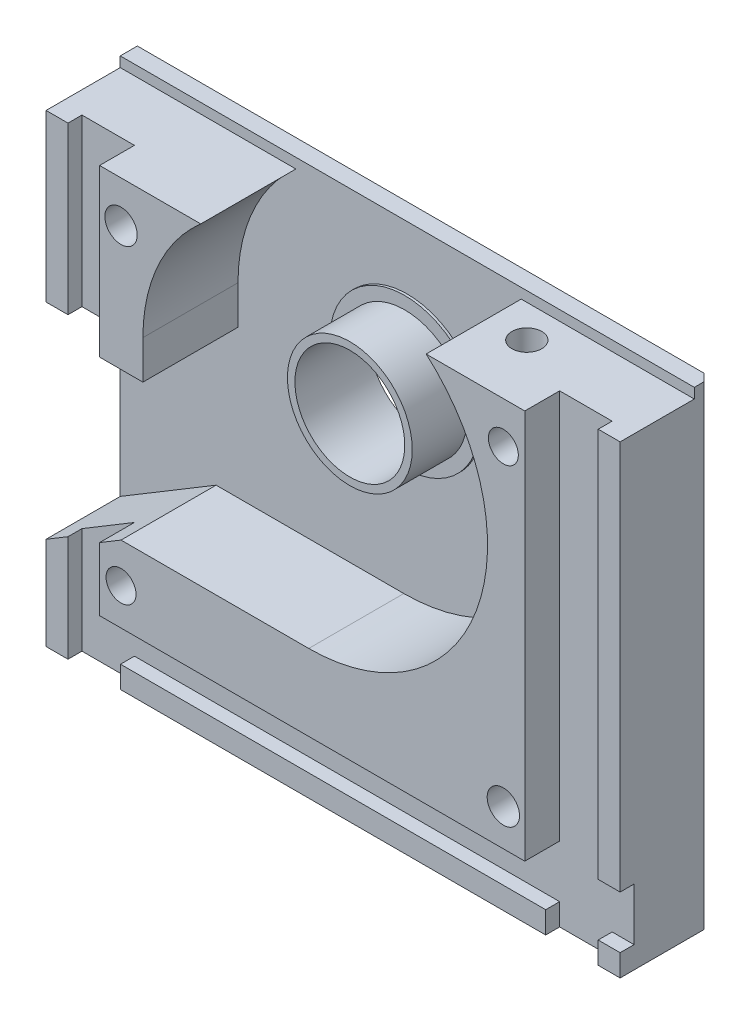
ISO-10303-21;
HEADER;
FILE_DESCRIPTION(('STEP AP214'),'2;1');
FILE_NAME('part.step','',(''),(''),'','','');
FILE_SCHEMA(('AUTOMOTIVE_DESIGN { 1 0 10303 214 1 1 1 1 }'));
ENDSEC;
DATA;
#1=APPLICATION_CONTEXT('core data for automotive mechanical design processes');
#2=APPLICATION_PROTOCOL_DEFINITION('international standard','automotive_design',2000,#1);
#3=PRODUCT_CONTEXT('',#1,'mechanical');
#4=PRODUCT('Part','Part','',(#3));
#5=PRODUCT_RELATED_PRODUCT_CATEGORY('part','',(#4));
#6=PRODUCT_DEFINITION_FORMATION('','',#4);
#7=PRODUCT_DEFINITION_CONTEXT('part definition',#1,'design');
#8=PRODUCT_DEFINITION('design','',#6,#7);
#9=PRODUCT_DEFINITION_SHAPE('','',#8);
#10=(LENGTH_UNIT() NAMED_UNIT(*) SI_UNIT(.MILLI.,.METRE.));
#11=(NAMED_UNIT(*) PLANE_ANGLE_UNIT() SI_UNIT($,.RADIAN.));
#12=(NAMED_UNIT(*) SI_UNIT($,.STERADIAN.) SOLID_ANGLE_UNIT());
#13=UNCERTAINTY_MEASURE_WITH_UNIT(LENGTH_MEASURE(1.E-05),#10,'distance_accuracy_value','');
#14=(GEOMETRIC_REPRESENTATION_CONTEXT(3) GLOBAL_UNCERTAINTY_ASSIGNED_CONTEXT((#13)) GLOBAL_UNIT_ASSIGNED_CONTEXT((#10,
#11,#12)) REPRESENTATION_CONTEXT('',''));
#15=CARTESIAN_POINT('',(0.,0.,0.));
#16=DIRECTION('',(0.,0.,1.));
#17=DIRECTION('',(1.,0.,0.));
#18=AXIS2_PLACEMENT_3D('',#15,#16,#17);
#19=CARTESIAN_POINT('',(42.5902,-63.0918,-6.985));
#20=DIRECTION('',(0.,-1.,0.));
#21=DIRECTION('',(0.,0.,1.));
#22=AXIS2_PLACEMENT_3D('',#19,#20,#21);
#23=PLANE('',#22);
#24=DIRECTION('',(0.,0.,1.));
#25=VECTOR('',#24,1.);
#26=CARTESIAN_POINT('',(-42.5902,-63.0918,-5.588));
#27=LINE('',#26,#25);
#28=CARTESIAN_POINT('',(-42.5902,-63.0918,-6.985));
#29=VERTEX_POINT('',#28);
#30=CARTESIAN_POINT('',(-42.5902,-63.0918,-4.191));
#31=VERTEX_POINT('',#30);
#32=EDGE_CURVE('E545',#29,#31,#27,.T.);
#33=ORIENTED_EDGE('',*,*,#32,.T.);
#34=DIRECTION('',(1.,0.,0.));
#35=VECTOR('',#34,1.);
#36=CARTESIAN_POINT('',(0.,-63.0918,-4.191));
#37=LINE('',#36,#35);
#38=CARTESIAN_POINT('',(42.5902,-63.0918,-4.191));
#39=VERTEX_POINT('',#38);
#40=EDGE_CURVE('E549',#31,#39,#37,.T.);
#41=ORIENTED_EDGE('',*,*,#40,.T.);
#42=DIRECTION('',(0.,0.,-1.));
#43=VECTOR('',#42,1.);
#44=CARTESIAN_POINT('',(42.5902,-63.0918,-5.588));
#45=LINE('',#44,#43);
#46=CARTESIAN_POINT('',(42.5902,-63.0918,-6.985));
#47=VERTEX_POINT('',#46);
#48=EDGE_CURVE('E551',#39,#47,#45,.T.);
#49=ORIENTED_EDGE('',*,*,#48,.T.);
#50=DIRECTION('',(-1.,0.,0.));
#51=VECTOR('',#50,1.);
#52=CARTESIAN_POINT('',(2.19710000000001,-63.0918,-6.985));
#53=LINE('',#52,#51);
#54=EDGE_CURVE('E611',#47,#29,#53,.T.);
#55=ORIENTED_EDGE('',*,*,#54,.T.);
#56=EDGE_LOOP('',(#33,#41,#49,#55));
#57=FACE_BOUND('',#56,.T.);
#58=ADVANCED_FACE('F16',(#57),#23,.F.);
#59=CARTESIAN_POINT('',(53.1058,25.5288,-6.985));
#60=DIRECTION('',(1.,0.,0.));
#61=DIRECTION('',(0.,0.,1.));
#62=AXIS2_PLACEMENT_3D('',#59,#60,#61);
#63=PLANE('',#62);
#64=DIRECTION('',(0.,0.,1.));
#65=VECTOR('',#64,1.);
#66=CARTESIAN_POINT('',(53.1058,-52.5762,-5.588));
#67=LINE('',#66,#65);
#68=CARTESIAN_POINT('',(53.1058,-52.5762,-6.985));
#69=VERTEX_POINT('',#68);
#70=CARTESIAN_POINT('',(53.1058,-52.5762,-4.191));
#71=VERTEX_POINT('',#70);
#72=EDGE_CURVE('E272',#69,#71,#67,.T.);
#73=ORIENTED_EDGE('',*,*,#72,.T.);
#74=DIRECTION('',(0.,1.,0.));
#75=VECTOR('',#74,1.);
#76=CARTESIAN_POINT('',(53.1058,-13.5237,-4.191));
#77=LINE('',#76,#75);
#78=CARTESIAN_POINT('',(53.1058,25.5288,-4.191));
#79=VERTEX_POINT('',#78);
#80=EDGE_CURVE('E269',#71,#79,#77,.T.);
#81=ORIENTED_EDGE('',*,*,#80,.T.);
#82=DIRECTION('',(0.,0.,-1.));
#83=VECTOR('',#82,1.);
#84=CARTESIAN_POINT('',(53.1058,25.5288,-9.525));
#85=LINE('',#84,#83);
#86=CARTESIAN_POINT('',(53.1058,25.5288,-6.985));
#87=VERTEX_POINT('',#86);
#88=EDGE_CURVE('E569',#79,#87,#85,.T.);
#89=ORIENTED_EDGE('',*,*,#88,.T.);
#90=DIRECTION('',(0.,-1.,0.));
#91=VECTOR('',#90,1.);
#92=CARTESIAN_POINT('',(53.1058,-20.9786,-6.985));
#93=LINE('',#92,#91);
#94=EDGE_CURVE('E565',#87,#69,#93,.T.);
#95=ORIENTED_EDGE('',*,*,#94,.T.);
#96=EDGE_LOOP('',(#73,#81,#89,#95));
#97=FACE_BOUND('',#96,.T.);
#98=ADVANCED_FACE('F806',(#97),#63,.F.);
#99=CARTESIAN_POINT('',(30.5,12.8288,-12.5));
#100=DIRECTION('',(0.,-1.,0.));
#101=DIRECTION('',(0.,0.,-1.));
#102=AXIS2_PLACEMENT_3D('',#99,#100,#101);
#103=CYLINDRICAL_SURFACE('',#102,3.);
#104=CARTESIAN_POINT('',(30.5,25.5288,-12.5));
#105=DIRECTION('',(0.,-1.,0.));
#106=DIRECTION('',(0.,0.,-1.));
#107=AXIS2_PLACEMENT_3D('',#104,#105,#106);
#108=CIRCLE('',#107,3.);
#109=CARTESIAN_POINT('',(30.5,25.5288,-15.5));
#110=VERTEX_POINT('',#109);
#111=EDGE_CURVE('E284',#110,#110,#108,.F.);
#112=ORIENTED_EDGE('',*,*,#111,.T.);
#113=EDGE_LOOP('',(#112));
#114=FACE_BOUND('',#113,.T.);
#115=CARTESIAN_POINT('',(27.5,20.6063922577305,-12.5));
#116=CARTESIAN_POINT('',(27.5000026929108,20.6063891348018,-12.6225782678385));
#117=CARTESIAN_POINT('',(27.5075880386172,20.5967226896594,-12.7451733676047));
#118=CARTESIAN_POINT('',(27.5370954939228,20.5590009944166,-12.9857204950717));
#119=CARTESIAN_POINT('',(27.5590301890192,20.5309296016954,-13.1036683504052));
#120=CARTESIAN_POINT('',(27.6148685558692,20.459114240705,-13.3303974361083));
#121=CARTESIAN_POINT('',(27.6486710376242,20.4155027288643,-13.4392468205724));
#122=CARTESIAN_POINT('',(27.7257572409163,20.3154223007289,-13.647123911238));
#123=CARTESIAN_POINT('',(27.7690454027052,20.2589473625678,-13.7461469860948));
#124=CARTESIAN_POINT('',(27.8854020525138,20.1060162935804,-13.9792241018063));
#125=CARTESIAN_POINT('',(27.9627544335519,20.0034258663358,-14.1070902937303));
#126=CARTESIAN_POINT('',(28.1271474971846,19.782533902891,-14.3412335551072));
#127=CARTESIAN_POINT('',(28.2142123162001,19.6641930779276,-14.4474548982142));
#128=CARTESIAN_POINT('',(28.3756698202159,19.4416187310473,-14.6209088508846));
#129=CARTESIAN_POINT('',(28.4490691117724,19.339365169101,-14.6916828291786));
#130=CARTESIAN_POINT('',(28.5980200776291,19.1294192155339,-14.8221288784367));
#131=CARTESIAN_POINT('',(28.6735730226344,19.0217235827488,-14.8817942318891));
#132=CARTESIAN_POINT('',(28.8258247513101,18.8020466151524,-14.9911703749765));
#133=CARTESIAN_POINT('',(28.9025245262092,18.6900614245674,-15.040871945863));
#134=CARTESIAN_POINT('',(29.0562864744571,18.4627369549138,-15.1312813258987));
#135=CARTESIAN_POINT('',(29.133348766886,18.3473964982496,-15.1719859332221));
#136=CARTESIAN_POINT('',(29.3433498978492,18.0290198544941,-15.271986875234));
#137=CARTESIAN_POINT('',(29.4760976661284,17.8233088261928,-15.323225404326));
#138=CARTESIAN_POINT('',(29.7391117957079,17.4062512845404,-15.4051707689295));
#139=CARTESIAN_POINT('',(29.8693762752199,17.1949007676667,-15.4358625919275));
#140=CARTESIAN_POINT('',(30.1266677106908,16.7674904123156,-15.4795471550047));
#141=CARTESIAN_POINT('',(30.2536820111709,16.5514168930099,-15.4924787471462));
#142=CARTESIAN_POINT('',(30.5032487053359,16.1164472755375,-15.5025956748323));
#143=CARTESIAN_POINT('',(30.6258020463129,15.8975517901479,-15.4997843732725));
#144=CARTESIAN_POINT('',(30.8388648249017,15.5074524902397,-15.4822580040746));
#145=CARTESIAN_POINT('',(30.9303581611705,15.3366473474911,-15.4703759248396));
#146=CARTESIAN_POINT('',(31.1102767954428,14.9941359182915,-15.4386915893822));
#147=CARTESIAN_POINT('',(31.1987017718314,14.8224295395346,-15.4188885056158));
#148=CARTESIAN_POINT('',(31.3724307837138,14.4782966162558,-15.3717541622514));
#149=CARTESIAN_POINT('',(31.4577321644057,14.3058695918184,-15.3444166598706));
#150=CARTESIAN_POINT('',(31.6250508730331,13.9607251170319,-15.2824843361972));
#151=CARTESIAN_POINT('',(31.7070681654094,13.7880076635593,-15.247889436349));
#152=CARTESIAN_POINT('',(31.8674384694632,13.4432417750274,-15.1716968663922));
#153=CARTESIAN_POINT('',(31.9458041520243,13.2711932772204,-15.1301261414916));
#154=CARTESIAN_POINT('',(32.0991158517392,12.9274768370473,-15.0398315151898));
#155=CARTESIAN_POINT('',(32.1740623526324,12.755808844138,-14.9911086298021));
#156=CARTESIAN_POINT('',(32.3203871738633,12.4134228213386,-14.8862700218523));
#157=CARTESIAN_POINT('',(32.3917689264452,12.2427040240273,-14.8301616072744));
#158=CARTESIAN_POINT('',(32.5309113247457,11.9026400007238,-14.7099462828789));
#159=CARTESIAN_POINT('',(32.598672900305,11.7332944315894,-14.6458414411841));
#160=CARTESIAN_POINT('',(32.6982855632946,11.4788291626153,-14.5420355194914));
#161=CARTESIAN_POINT('',(32.7315409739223,11.3928902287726,-14.5056700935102));
#162=CARTESIAN_POINT('',(32.7970137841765,11.2217573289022,-14.4303420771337));
#163=CARTESIAN_POINT('',(32.8292312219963,11.1365633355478,-14.3913795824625));
#164=CARTESIAN_POINT('',(32.8926298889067,10.9669887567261,-14.3105155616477));
#165=CARTESIAN_POINT('',(32.9238092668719,10.8826097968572,-14.2686091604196));
#166=CARTESIAN_POINT('',(32.9849977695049,10.7151123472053,-14.1815522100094));
#167=CARTESIAN_POINT('',(33.0150069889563,10.6319937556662,-14.1364019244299));
#168=CARTESIAN_POINT('',(33.0739882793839,10.4667569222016,-14.0419824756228));
#169=CARTESIAN_POINT('',(33.1029499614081,10.3846522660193,-13.9926828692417));
#170=CARTESIAN_POINT('',(33.1594036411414,10.2227824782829,-13.8896138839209));
#171=CARTESIAN_POINT('',(33.1868960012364,10.1430167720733,-13.8358456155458));
#172=CARTESIAN_POINT('',(33.2401053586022,9.98691762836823,-13.7229932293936));
#173=CARTESIAN_POINT('',(33.2658254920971,9.91057821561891,-13.6639189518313));
#174=CARTESIAN_POINT('',(33.3150811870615,9.76283072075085,-13.5391426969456));
#175=CARTESIAN_POINT('',(33.3386196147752,9.69141620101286,-13.4734496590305));
#176=CARTESIAN_POINT('',(33.3803508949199,9.56357978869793,-13.3413339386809));
#177=CARTESIAN_POINT('',(33.3988468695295,9.50637252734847,-13.2757798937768));
#178=CARTESIAN_POINT('',(33.4325244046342,9.401434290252,-13.136703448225));
#179=CARTESIAN_POINT('',(33.4477160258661,9.3536745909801,-13.06320628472));
#180=CARTESIAN_POINT('',(33.4686616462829,9.28747650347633,-12.9354335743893));
#181=CARTESIAN_POINT('',(33.4758474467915,9.26466164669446,-12.8836928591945));
#182=CARTESIAN_POINT('',(33.4876574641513,9.22707733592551,-12.7770712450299));
#183=CARTESIAN_POINT('',(33.4922849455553,9.21229762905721,-12.722194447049));
#184=CARTESIAN_POINT('',(33.498513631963,9.19238763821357,-12.6099688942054));
#185=CARTESIAN_POINT('',(33.5000869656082,9.1873462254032,-12.552602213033));
#186=CARTESIAN_POINT('',(33.4999055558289,9.18792701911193,-12.4379245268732));
#187=CARTESIAN_POINT('',(33.4981507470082,9.19354943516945,-12.380613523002));
#188=CARTESIAN_POINT('',(33.4919226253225,9.21345401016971,-12.2743403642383));
#189=CARTESIAN_POINT('',(33.4877722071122,9.2267071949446,-12.2251569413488));
#190=CARTESIAN_POINT('',(33.4773987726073,9.25972893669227,-12.1292927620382));
#191=CARTESIAN_POINT('',(33.4711748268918,9.27950041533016,-12.0826131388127));
#192=CARTESIAN_POINT('',(33.4518630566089,9.34060623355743,-11.9588655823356));
#193=CARTESIAN_POINT('',(33.4370901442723,9.38711633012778,-11.8846383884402));
#194=CARTESIAN_POINT('',(33.4041293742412,9.48998059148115,-11.7441742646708));
#195=CARTESIAN_POINT('',(33.3859289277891,9.54637099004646,-11.6779683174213));
#196=CARTESIAN_POINT('',(33.3421174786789,9.680817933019,-11.5360374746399));
#197=CARTESIAN_POINT('',(33.3158080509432,9.76070326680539,-11.4622883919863));
#198=CARTESIAN_POINT('',(33.2604829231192,9.92654603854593,-11.3229929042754));
#199=CARTESIAN_POINT('',(33.2314622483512,10.0125145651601,-11.2574621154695));
#200=CARTESIAN_POINT('',(33.1711806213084,10.1887562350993,-11.1326623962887));
#201=CARTESIAN_POINT('',(33.1399095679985,10.2790480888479,-11.0734250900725));
#202=CARTESIAN_POINT('',(33.0756170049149,10.4622273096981,-10.9603850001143));
#203=CARTESIAN_POINT('',(33.0425968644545,10.5551126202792,-10.9065780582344));
#204=CARTESIAN_POINT('',(32.9613873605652,10.7805228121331,-10.7827174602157));
#205=CARTESIAN_POINT('',(32.9124388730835,10.9139637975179,-10.7148344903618));
#206=CARTESIAN_POINT('',(32.8117791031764,11.1832833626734,-10.5862785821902));
#207=CARTESIAN_POINT('',(32.7600667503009,11.3191628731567,-10.5256084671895));
#208=CARTESIAN_POINT('',(32.6540055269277,11.5927366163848,-10.4104075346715));
#209=CARTESIAN_POINT('',(32.599652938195,11.7304331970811,-10.3558857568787));
#210=CARTESIAN_POINT('',(32.4884945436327,12.0069393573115,-10.2524118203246));
#211=CARTESIAN_POINT('',(32.4316883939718,12.145749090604,-10.2034604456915));
#212=CARTESIAN_POINT('',(32.3156137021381,12.4243246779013,-10.1106322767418));
#213=CARTESIAN_POINT('',(32.2563412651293,12.5640917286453,-10.0667639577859));
#214=CARTESIAN_POINT('',(32.1354781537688,12.8440818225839,-9.98393699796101));
#215=CARTESIAN_POINT('',(32.073887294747,12.9843049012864,-9.94497874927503));
#216=CARTESIAN_POINT('',(31.8858226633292,13.4050558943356,-9.83530804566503));
#217=CARTESIAN_POINT('',(31.7559387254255,13.6859495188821,-9.7717060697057));
#218=CARTESIAN_POINT('',(31.4804684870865,14.2617492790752,-9.66066091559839));
#219=CARTESIAN_POINT('',(31.334417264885,14.5566272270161,-9.61422592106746));
#220=CARTESIAN_POINT('',(31.0329885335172,15.1445295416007,-9.54366817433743));
#221=CARTESIAN_POINT('',(30.8776057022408,15.4375527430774,-9.51955828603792));
#222=CARTESIAN_POINT('',(30.5590814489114,16.0184884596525,-9.49635407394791));
#223=CARTESIAN_POINT('',(30.3959857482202,16.3064198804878,-9.49712722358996));
#224=CARTESIAN_POINT('',(30.1460154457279,16.7338329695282,-9.51978816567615));
#225=CARTESIAN_POINT('',(30.0618351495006,16.8755069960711,-9.53091756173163));
#226=CARTESIAN_POINT('',(29.8919108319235,17.1570603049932,-9.56100724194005));
#227=CARTESIAN_POINT('',(29.8061671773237,17.2969399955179,-9.5799657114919));
#228=CARTESIAN_POINT('',(29.6578010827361,17.5353121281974,-9.61992691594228));
#229=CARTESIAN_POINT('',(29.5954819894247,17.6343447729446,-9.63884306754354));
#230=CARTESIAN_POINT('',(29.4703593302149,17.831051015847,-9.68145357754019));
#231=CARTESIAN_POINT('',(29.4075558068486,17.9287247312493,-9.70514752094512));
#232=CARTESIAN_POINT('',(29.2185740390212,18.2195379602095,-9.78400420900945));
#233=CARTESIAN_POINT('',(29.0919043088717,18.4103416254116,-9.84692140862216));
#234=CARTESIAN_POINT('',(28.8386301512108,18.7842298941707,-9.99765596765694));
#235=CARTESIAN_POINT('',(28.7120312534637,18.9672577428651,-10.0856290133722));
#236=CARTESIAN_POINT('',(28.5258630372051,19.231405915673,-10.239638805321));
#237=CARTESIAN_POINT('',(28.4644470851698,19.3176979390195,-10.2946300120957));
#238=CARTESIAN_POINT('',(28.3435744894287,19.4860094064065,-10.4126649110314));
#239=CARTESIAN_POINT('',(28.2841170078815,19.5680306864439,-10.4757051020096));
#240=CARTESIAN_POINT('',(28.150861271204,19.75030787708,-10.6305466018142));
#241=CARTESIAN_POINT('',(28.0780268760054,19.8487758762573,-10.725338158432));
#242=CARTESIAN_POINT('',(27.939989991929,20.0336074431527,-10.9310344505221));
#243=CARTESIAN_POINT('',(27.8747804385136,20.1199822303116,-11.0419240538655));
#244=CARTESIAN_POINT('',(27.7659056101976,20.2630693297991,-11.2602501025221));
#245=CARTESIAN_POINT('',(27.7204617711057,20.3223276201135,-11.3651051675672));
#246=CARTESIAN_POINT('',(27.6403331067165,20.42629189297,-11.5856594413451));
#247=CARTESIAN_POINT('',(27.605636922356,20.4710132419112,-11.7013470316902));
#248=CARTESIAN_POINT('',(27.5526386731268,20.5391160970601,-11.9295642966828));
#249=CARTESIAN_POINT('',(27.5330635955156,20.5641588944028,-12.0412931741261));
#250=CARTESIAN_POINT('',(27.5067467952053,20.5977935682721,-12.268677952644));
#251=CARTESIAN_POINT('',(27.4999974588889,20.6063952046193,-12.3843314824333));
#252=CARTESIAN_POINT('',(27.5,20.6063922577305,-12.5));
#253=B_SPLINE_CURVE_WITH_KNOTS('',3,(#115,#116,#117,#118,#119,#120,#121,#122,#123,#124,#125,
#126,#127,#128,#129,#130,#131,#132,#133,#134,#135,#136,#137,#138,#139,#140,#141,#142,#143,#144,
#145,#146,#147,#148,#149,#150,#151,#152,#153,#154,#155,#156,#157,#158,#159,#160,#161,#162,#163,
#164,#165,#166,#167,#168,#169,#170,#171,#172,#173,#174,#175,#176,#177,#178,#179,#180,#181,#182,
#183,#184,#185,#186,#187,#188,#189,#190,#191,#192,#193,#194,#195,#196,#197,#198,#199,#200,#201,
#202,#203,#204,#205,#206,#207,#208,#209,#210,#211,#212,#213,#214,#215,#216,#217,#218,#219,#220,
#221,#222,#223,#224,#225,#226,#227,#228,#229,#230,#231,#232,#233,#234,#235,#236,#237,#238,#239,
#240,#241,#242,#243,#244,#245,#246,#247,#248,#249,#250,#251,#252),.UNSPECIFIED.,.T.,.F.,(4,2,2,
2,2,2,2,2,2,2,2,2,2,2,2,2,2,2,2,2,2,2,2,2,2,2,2,2,2,2,2,2,2,2,2,2,2,2,2,2,2,2,2,2,2,2,2,2,2,2,2,
2,2,2,2,2,2,2,2,2,2,2,2,2,2,2,2,2,4),(0.,0.367185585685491,0.734693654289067,1.09914138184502,
1.463760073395,2.00453055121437,2.54667616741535,2.97929459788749,3.41217379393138,
3.84545167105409,4.27888349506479,5.0280644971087,5.77779229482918,6.53009496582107,
7.2822369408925,7.86444351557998,8.44671093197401,9.0294622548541,9.61221988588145,
10.1927762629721,10.7732502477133,11.3531541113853,11.9329083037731,12.2300692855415,
12.5272193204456,12.8248735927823,13.1225037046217,13.4225483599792,13.7225186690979,
14.0219437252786,14.3209696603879,14.5872311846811,14.852670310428,15.0231102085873,
15.1933321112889,15.3651002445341,15.5368717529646,15.68960317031,15.842403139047,
16.10734559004,16.3732808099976,16.7080938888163,17.0435338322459,17.3805866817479,
17.7173794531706,18.1896432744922,18.6620913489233,19.1352252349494,19.6084256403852,
20.0824040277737,20.5564202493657,21.5034902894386,22.4996393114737,23.4963619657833,
24.4877769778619,24.9831317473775,25.478371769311,25.8338589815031,26.1893153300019,
26.9006827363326,27.616570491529,27.9742930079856,28.3318604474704,28.7952558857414,
29.2582185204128,29.6429697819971,30.0273130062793,30.3740061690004,30.7204934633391),.UNSPECIFIED.);
#254=CARTESIAN_POINT('',(27.5,20.6063922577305,-12.5));
#255=VERTEX_POINT('',#254);
#256=EDGE_CURVE('E275',#255,#255,#253,.T.);
#257=ORIENTED_EDGE('',*,*,#256,.T.);
#258=EDGE_LOOP('',(#257));
#259=FACE_BOUND('',#258,.T.);
#260=ADVANCED_FACE('F286',(#114,#259),#103,.F.);
#261=CARTESIAN_POINT('',(0.,0.,-18.55));
#262=DIRECTION('',(0.,0.,-1.));
#263=DIRECTION('',(-1.,0.,0.));
#264=AXIS2_PLACEMENT_3D('',#261,#262,#263);
#265=PLANE('',#264);
#266=CARTESIAN_POINT('',(0.,0.,-18.55));
#267=DIRECTION('',(0.,0.,1.));
#268=DIRECTION('',(1.,0.,0.));
#269=AXIS2_PLACEMENT_3D('',#266,#267,#268);
#270=CIRCLE('',#269,12.5);
#271=CARTESIAN_POINT('',(12.5,0.,-18.55));
#272=VERTEX_POINT('',#271);
#273=EDGE_CURVE('E520',#272,#272,#270,.T.);
#274=ORIENTED_EDGE('',*,*,#273,.F.);
#275=EDGE_LOOP('',(#274));
#276=FACE_BOUND('',#275,.T.);
#277=CARTESIAN_POINT('',(0.,0.,-18.55));
#278=DIRECTION('',(0.,0.,1.));
#279=DIRECTION('',(1.,0.,0.));
#280=AXIS2_PLACEMENT_3D('',#277,#278,#279);
#281=CIRCLE('',#280,15.);
#282=CARTESIAN_POINT('',(15.,0.,-18.55));
#283=VERTEX_POINT('',#282);
#284=EDGE_CURVE('E267',#283,#283,#281,.F.);
#285=ORIENTED_EDGE('',*,*,#284,.F.);
#286=EDGE_LOOP('',(#285));
#287=FACE_BOUND('',#286,.T.);
#288=ADVANCED_FACE('F867',(#276,#287),#265,.F.);
#289=CARTESIAN_POINT('',(53.1058,-63.0918,-6.985));
#290=DIRECTION('',(1.,0.,0.));
#291=DIRECTION('',(0.,0.,1.));
#292=AXIS2_PLACEMENT_3D('',#289,#290,#291);
#293=PLANE('',#292);
#294=DIRECTION('',(0.,0.,-1.));
#295=VECTOR('',#294,1.);
#296=CARTESIAN_POINT('',(53.1058,-67.486,-12.585));
#297=LINE('',#296,#295);
#298=CARTESIAN_POINT('',(53.1058,-67.486,-4.191));
#299=VERTEX_POINT('',#298);
#300=CARTESIAN_POINT('',(53.1058,-67.486,-6.985));
#301=VERTEX_POINT('',#300);
#302=EDGE_CURVE('E680',#299,#301,#297,.T.);
#303=ORIENTED_EDGE('',*,*,#302,.F.);
#304=DIRECTION('',(0.,1.,0.));
#305=VECTOR('',#304,1.);
#306=CARTESIAN_POINT('',(53.1058,-65.2889,-4.191));
#307=LINE('',#306,#305);
#308=CARTESIAN_POINT('',(53.1058,-63.0918,-4.191));
#309=VERTEX_POINT('',#308);
#310=EDGE_CURVE('E592',#299,#309,#307,.T.);
#311=ORIENTED_EDGE('',*,*,#310,.T.);
#312=DIRECTION('',(0.,0.,-1.));
#313=VECTOR('',#312,1.);
#314=CARTESIAN_POINT('',(53.1058,-63.0918,-5.588));
#315=LINE('',#314,#313);
#316=CARTESIAN_POINT('',(53.1058,-63.0918,-6.985));
#317=VERTEX_POINT('',#316);
#318=EDGE_CURVE('E605',#309,#317,#315,.T.);
#319=ORIENTED_EDGE('',*,*,#318,.T.);
#320=DIRECTION('',(0.,-1.,0.));
#321=VECTOR('',#320,1.);
#322=CARTESIAN_POINT('',(53.1058,-20.9786,-6.985));
#323=LINE('',#322,#321);
#324=EDGE_CURVE('E574',#317,#301,#323,.T.);
#325=ORIENTED_EDGE('',*,*,#324,.T.);
#326=EDGE_LOOP('',(#303,#311,#319,#325));
#327=FACE_BOUND('',#326,.T.);
#328=ADVANCED_FACE('F694',(#327),#293,.F.);
#329=CARTESIAN_POINT('',(42.5902,-63.0918,-4.191));
#330=DIRECTION('',(-1.,0.,0.));
#331=DIRECTION('',(0.,0.,-1.));
#332=AXIS2_PLACEMENT_3D('',#329,#330,#331);
#333=PLANE('',#332);
#334=ORIENTED_EDGE('',*,*,#48,.F.);
#335=DIRECTION('',(0.,-1.,0.));
#336=VECTOR('',#335,1.);
#337=CARTESIAN_POINT('',(42.5902,-65.2889,-4.191));
#338=LINE('',#337,#336);
#339=CARTESIAN_POINT('',(42.5902,-67.486,-4.191));
#340=VERTEX_POINT('',#339);
#341=EDGE_CURVE('E547',#39,#340,#338,.T.);
#342=ORIENTED_EDGE('',*,*,#341,.T.);
#343=DIRECTION('',(0.,0.,1.));
#344=VECTOR('',#343,1.);
#345=CARTESIAN_POINT('',(42.5902,-67.486,-12.585));
#346=LINE('',#345,#344);
#347=CARTESIAN_POINT('',(42.5902,-67.486,-6.985));
#348=VERTEX_POINT('',#347);
#349=EDGE_CURVE('E675',#348,#340,#346,.T.);
#350=ORIENTED_EDGE('',*,*,#349,.F.);
#351=DIRECTION('',(0.,1.,0.));
#352=VECTOR('',#351,1.);
#353=CARTESIAN_POINT('',(42.5902,-20.9786,-6.985));
#354=LINE('',#353,#352);
#355=EDGE_CURVE('E613',#348,#47,#354,.T.);
#356=ORIENTED_EDGE('',*,*,#355,.T.);
#357=EDGE_LOOP('',(#334,#342,#350,#356));
#358=FACE_BOUND('',#357,.T.);
#359=ADVANCED_FACE('F704',(#358),#333,.F.);
#360=CARTESIAN_POINT('',(-42.5902,-63.0918,-4.191));
#361=DIRECTION('',(0.,0.,-1.));
#362=DIRECTION('',(1.,0.,0.));
#363=AXIS2_PLACEMENT_3D('',#360,#361,#362);
#364=PLANE('',#363);
#365=ORIENTED_EDGE('',*,*,#40,.F.);
#366=DIRECTION('',(0.,-1.,0.));
#367=VECTOR('',#366,1.);
#368=CARTESIAN_POINT('',(-42.5902,-65.2889,-4.191));
#369=LINE('',#368,#367);
#370=CARTESIAN_POINT('',(-42.5902,-67.486,-4.191));
#371=VERTEX_POINT('',#370);
#372=EDGE_CURVE('E542',#31,#371,#369,.T.);
#373=ORIENTED_EDGE('',*,*,#372,.T.);
#374=DIRECTION('',(-1.,0.,0.));
#375=VECTOR('',#374,1.);
#376=CARTESIAN_POINT('',(0.,-67.486,-4.191));
#377=LINE('',#376,#375);
#378=EDGE_CURVE('E672',#340,#371,#377,.T.);
#379=ORIENTED_EDGE('',*,*,#378,.F.);
#380=ORIENTED_EDGE('',*,*,#341,.F.);
#381=EDGE_LOOP('',(#365,#373,#379,#380));
#382=FACE_BOUND('',#381,.T.);
#383=ADVANCED_FACE('F708',(#382),#364,.F.);
#384=CARTESIAN_POINT('',(-42.5902,-63.0918,-6.985));
#385=DIRECTION('',(1.,0.,0.));
#386=DIRECTION('',(0.,0.,1.));
#387=AXIS2_PLACEMENT_3D('',#384,#385,#386);
#388=PLANE('',#387);
#389=DIRECTION('',(0.,0.,-1.));
#390=VECTOR('',#389,1.);
#391=CARTESIAN_POINT('',(-42.5902,-67.486,-12.585));
#392=LINE('',#391,#390);
#393=CARTESIAN_POINT('',(-42.5902,-67.486,-6.985));
#394=VERTEX_POINT('',#393);
#395=EDGE_CURVE('E669',#371,#394,#392,.T.);
#396=ORIENTED_EDGE('',*,*,#395,.F.);
#397=ORIENTED_EDGE('',*,*,#372,.F.);
#398=ORIENTED_EDGE('',*,*,#32,.F.);
#399=DIRECTION('',(0.,-1.,0.));
#400=VECTOR('',#399,1.);
#401=CARTESIAN_POINT('',(-42.5902,-20.9786,-6.985));
#402=LINE('',#401,#400);
#403=EDGE_CURVE('E609',#29,#394,#402,.T.);
#404=ORIENTED_EDGE('',*,*,#403,.T.);
#405=EDGE_LOOP('',(#396,#397,#398,#404));
#406=FACE_BOUND('',#405,.T.);
#407=ADVANCED_FACE('F713',(#406),#388,.F.);
#408=CARTESIAN_POINT('',(-53.1058,-46.2235281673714,-4.191));
#409=DIRECTION('',(-1.,0.,0.));
#410=DIRECTION('',(0.,0.,-1.));
#411=AXIS2_PLACEMENT_3D('',#408,#409,#410);
#412=PLANE('',#411);
#413=DIRECTION('',(0.,-1.,0.));
#414=VECTOR('',#413,1.);
#415=CARTESIAN_POINT('',(-53.1058,-56.8547640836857,-4.191));
#416=LINE('',#415,#414);
#417=CARTESIAN_POINT('',(-53.1058,-46.2235281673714,-4.191));
#418=VERTEX_POINT('',#417);
#419=CARTESIAN_POINT('',(-53.1058,-67.486,-4.191));
#420=VERTEX_POINT('',#419);
#421=EDGE_CURVE('E660',#418,#420,#416,.T.);
#422=ORIENTED_EDGE('',*,*,#421,.T.);
#423=DIRECTION('',(0.,0.,1.));
#424=VECTOR('',#423,1.);
#425=CARTESIAN_POINT('',(-53.1058,-67.486,-12.585));
#426=LINE('',#425,#424);
#427=CARTESIAN_POINT('',(-53.1058,-67.486,-6.985));
#428=VERTEX_POINT('',#427);
#429=EDGE_CURVE('E664',#428,#420,#426,.T.);
#430=ORIENTED_EDGE('',*,*,#429,.F.);
#431=DIRECTION('',(0.,1.,0.));
#432=VECTOR('',#431,1.);
#433=CARTESIAN_POINT('',(-53.1058,-20.9786,-6.985));
#434=LINE('',#433,#432);
#435=CARTESIAN_POINT('',(-53.1058,-46.2235281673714,-6.985));
#436=VERTEX_POINT('',#435);
#437=EDGE_CURVE('E607',#428,#436,#434,.T.);
#438=ORIENTED_EDGE('',*,*,#437,.T.);
#439=DIRECTION('',(0.,0.,1.));
#440=VECTOR('',#439,1.);
#441=CARTESIAN_POINT('',(-53.1058,-46.2235281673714,-9.525));
#442=LINE('',#441,#440);
#443=EDGE_CURVE('E540',#436,#418,#442,.T.);
#444=ORIENTED_EDGE('',*,*,#443,.T.);
#445=EDGE_LOOP('',(#422,#430,#438,#444));
#446=FACE_BOUND('',#445,.T.);
#447=ADVANCED_FACE('F718',(#446),#412,.F.);
#448=CARTESIAN_POINT('',(-53.1058,25.5288,-6.985));
#449=DIRECTION('',(0.,0.,-1.));
#450=DIRECTION('',(1.,0.,0.));
#451=AXIS2_PLACEMENT_3D('',#448,#449,#450);
#452=PLANE('',#451);
#453=DIRECTION('',(0.,1.,0.));
#454=VECTOR('',#453,1.);
#455=CARTESIAN_POINT('',(-42.5902,8.90449999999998,-6.985));
#456=LINE('',#455,#454);
#457=CARTESIAN_POINT('',(-42.5902,-7.71980000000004,-6.985));
#458=VERTEX_POINT('',#457);
#459=CARTESIAN_POINT('',(-42.5902,25.5288,-6.985));
#460=VERTEX_POINT('',#459);
#461=EDGE_CURVE('E644',#458,#460,#456,.T.);
#462=ORIENTED_EDGE('',*,*,#461,.T.);
#463=DIRECTION('',(-1.,0.,0.));
#464=VECTOR('',#463,1.);
#465=CARTESIAN_POINT('',(-39.9090843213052,25.5288,-6.985));
#466=LINE('',#465,#464);
#467=CARTESIAN_POINT('',(-53.1057999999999,25.5288,-6.985));
#468=VERTEX_POINT('',#467);
#469=EDGE_CURVE('E751',#460,#468,#466,.T.);
#470=ORIENTED_EDGE('',*,*,#469,.T.);
#471=DIRECTION('',(0.,-1.,0.));
#472=VECTOR('',#471,1.);
#473=CARTESIAN_POINT('',(-53.1057999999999,8.90449999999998,-6.985));
#474=LINE('',#473,#472);
#475=CARTESIAN_POINT('',(-53.1058,-7.71980000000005,-6.985));
#476=VERTEX_POINT('',#475);
#477=EDGE_CURVE('E544',#468,#476,#474,.T.);
#478=ORIENTED_EDGE('',*,*,#477,.T.);
#479=DIRECTION('',(1.,0.,0.));
#480=VECTOR('',#479,1.);
#481=CARTESIAN_POINT('',(-45.7045,-7.71980000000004,-6.985));
#482=LINE('',#481,#480);
#483=EDGE_CURVE('E757',#476,#458,#482,.T.);
#484=ORIENTED_EDGE('',*,*,#483,.T.);
#485=EDGE_LOOP('',(#462,#470,#478,#484));
#486=FACE_BOUND('',#485,.T.);
#487=ADVANCED_FACE('F775',(#486),#452,.F.);
#488=CARTESIAN_POINT('',(-53.1057999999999,25.5288,-4.191));
#489=DIRECTION('',(-1.,0.,0.));
#490=DIRECTION('',(0.,0.,-1.));
#491=AXIS2_PLACEMENT_3D('',#488,#489,#490);
#492=PLANE('',#491);
#493=ORIENTED_EDGE('',*,*,#477,.F.);
#494=DIRECTION('',(0.,0.,1.));
#495=VECTOR('',#494,1.);
#496=CARTESIAN_POINT('',(-53.1057999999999,25.5288,-9.525));
#497=LINE('',#496,#495);
#498=CARTESIAN_POINT('',(-53.1057999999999,25.5288,-4.191));
#499=VERTEX_POINT('',#498);
#500=EDGE_CURVE('E749',#468,#499,#497,.T.);
#501=ORIENTED_EDGE('',*,*,#500,.T.);
#502=DIRECTION('',(0.,-1.,0.));
#503=VECTOR('',#502,1.);
#504=CARTESIAN_POINT('',(-53.1057999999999,8.90449999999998,-4.191));
#505=LINE('',#504,#503);
#506=CARTESIAN_POINT('',(-53.1057999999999,-7.71980000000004,-4.191));
#507=VERTEX_POINT('',#506);
#508=EDGE_CURVE('E753',#499,#507,#505,.T.);
#509=ORIENTED_EDGE('',*,*,#508,.T.);
#510=DIRECTION('',(0.,0.,-1.));
#511=VECTOR('',#510,1.);
#512=CARTESIAN_POINT('',(-53.1057999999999,-7.71980000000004,-9.525));
#513=LINE('',#512,#511);
#514=EDGE_CURVE('E637',#507,#476,#513,.T.);
#515=ORIENTED_EDGE('',*,*,#514,.T.);
#516=EDGE_LOOP('',(#493,#501,#509,#515));
#517=FACE_BOUND('',#516,.T.);
#518=ADVANCED_FACE('F765',(#517),#492,.F.);
#519=CARTESIAN_POINT('',(-42.5902,25.5288,0.));
#520=DIRECTION('',(0.,0.,-1.));
#521=DIRECTION('',(1.,0.,0.));
#522=AXIS2_PLACEMENT_3D('',#519,#520,#521);
#523=PLANE('',#522);
#524=CARTESIAN_POINT('',(-38.2948,17.2103,0.));
#525=DIRECTION('',(0.,0.,-1.));
#526=DIRECTION('',(-1.,0.,0.));
#527=AXIS2_PLACEMENT_3D('',#524,#525,#526);
#528=CIRCLE('',#527,3.2385);
#529=CARTESIAN_POINT('',(-41.5333,17.2103,0.));
#530=VERTEX_POINT('',#529);
#531=EDGE_CURVE('E517',#530,#530,#528,.T.);
#532=ORIENTED_EDGE('',*,*,#531,.T.);
#533=EDGE_LOOP('',(#532));
#534=FACE_BOUND('',#533,.T.);
#535=DIRECTION('',(1.,0.,0.));
#536=VECTOR('',#535,1.);
#537=CARTESIAN_POINT('',(-45.7045,-7.71980000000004,0.));
#538=LINE('',#537,#536);
#539=CARTESIAN_POINT('',(-42.5902,-7.71980000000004,0.));
#540=VERTEX_POINT('',#539);
#541=CARTESIAN_POINT('',(-33.909,-7.71980000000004,0.));
#542=VERTEX_POINT('',#541);
#543=EDGE_CURVE('E250',#540,#542,#538,.T.);
#544=ORIENTED_EDGE('',*,*,#543,.T.);
#545=DIRECTION('',(0.,1.,0.));
#546=VECTOR('',#545,1.);
#547=CARTESIAN_POINT('',(-33.909,-3.85990000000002,0.));
#548=LINE('',#547,#546);
#549=CARTESIAN_POINT('',(-33.909,0.,0.));
#550=VERTEX_POINT('',#549);
#551=EDGE_CURVE('E244',#542,#550,#548,.T.);
#552=ORIENTED_EDGE('',*,*,#551,.T.);
#553=CARTESIAN_POINT('',(0.,0.,0.));
#554=DIRECTION('',(0.,0.,-1.));
#555=DIRECTION('',(-1.,0.,0.));
#556=AXIS2_PLACEMENT_3D('',#553,#554,#555);
#557=CIRCLE('',#556,33.909);
#558=CARTESIAN_POINT('',(-22.3181686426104,25.5288,0.));
#559=VERTEX_POINT('',#558);
#560=EDGE_CURVE('E20',#550,#559,#557,.T.);
#561=ORIENTED_EDGE('',*,*,#560,.T.);
#562=DIRECTION('',(-1.,0.,0.));
#563=VECTOR('',#562,1.);
#564=CARTESIAN_POINT('',(-39.9090843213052,25.5288,0.));
#565=LINE('',#564,#563);
#566=CARTESIAN_POINT('',(-42.5902,25.5288,0.));
#567=VERTEX_POINT('',#566);
#568=EDGE_CURVE('E624',#559,#567,#565,.T.);
#569=ORIENTED_EDGE('',*,*,#568,.T.);
#570=DIRECTION('',(0.,-1.,0.));
#571=VECTOR('',#570,1.);
#572=CARTESIAN_POINT('',(-42.5902,8.90449999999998,0.));
#573=LINE('',#572,#571);
#574=EDGE_CURVE('E254',#567,#540,#573,.T.);
#575=ORIENTED_EDGE('',*,*,#574,.T.);
#576=EDGE_LOOP('',(#544,#552,#561,#569,#575));
#577=FACE_BOUND('',#576,.T.);
#578=ADVANCED_FACE('F246',(#534,#577),#523,.F.);
#579=CARTESIAN_POINT('',(-42.5902,25.5288,-6.985));
#580=DIRECTION('',(1.,0.,0.));
#581=DIRECTION('',(0.,0.,1.));
#582=AXIS2_PLACEMENT_3D('',#579,#580,#581);
#583=PLANE('',#582);
#584=ORIENTED_EDGE('',*,*,#574,.F.);
#585=DIRECTION('',(0.,0.,-1.));
#586=VECTOR('',#585,1.);
#587=CARTESIAN_POINT('',(-42.5902,25.5288,-9.525));
#588=LINE('',#587,#586);
#589=EDGE_CURVE('E634',#567,#460,#588,.T.);
#590=ORIENTED_EDGE('',*,*,#589,.T.);
#591=ORIENTED_EDGE('',*,*,#461,.F.);
#592=DIRECTION('',(0.,0.,1.));
#593=VECTOR('',#592,1.);
#594=CARTESIAN_POINT('',(-42.5902,-7.71980000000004,-9.525));
#595=LINE('',#594,#593);
#596=EDGE_CURVE('E536',#458,#540,#595,.T.);
#597=ORIENTED_EDGE('',*,*,#596,.T.);
#598=EDGE_LOOP('',(#584,#590,#591,#597));
#599=FACE_BOUND('',#598,.T.);
#600=ADVANCED_FACE('F772',(#599),#583,.F.);
#601=CARTESIAN_POINT('',(-33.909,0.,0.));
#602=DIRECTION('',(-1.,0.,0.));
#603=DIRECTION('',(0.,0.,-1.));
#604=AXIS2_PLACEMENT_3D('',#601,#602,#603);
#605=PLANE('',#604);
#606=DIRECTION('',(0.,0.,1.));
#607=VECTOR('',#606,1.);
#608=CARTESIAN_POINT('',(-33.909,0.,-9.525));
#609=LINE('',#608,#607);
#610=CARTESIAN_POINT('',(-33.909,0.,-19.05));
#611=VERTEX_POINT('',#610);
#612=EDGE_CURVE('E253',#611,#550,#609,.T.);
#613=ORIENTED_EDGE('',*,*,#612,.T.);
#614=ORIENTED_EDGE('',*,*,#551,.F.);
#615=DIRECTION('',(0.,0.,-1.));
#616=VECTOR('',#615,1.);
#617=CARTESIAN_POINT('',(-33.909,-7.71980000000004,-9.525));
#618=LINE('',#617,#616);
#619=CARTESIAN_POINT('',(-33.909,-7.71980000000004,-19.05));
#620=VERTEX_POINT('',#619);
#621=EDGE_CURVE('E635',#542,#620,#618,.T.);
#622=ORIENTED_EDGE('',*,*,#621,.T.);
#623=DIRECTION('',(0.,1.,0.));
#624=VECTOR('',#623,1.);
#625=CARTESIAN_POINT('',(-33.909,-10.6535,-19.05));
#626=LINE('',#625,#624);
#627=EDGE_CURVE('E259',#620,#611,#626,.T.);
#628=ORIENTED_EDGE('',*,*,#627,.T.);
#629=EDGE_LOOP('',(#613,#614,#622,#628));
#630=FACE_BOUND('',#629,.T.);
#631=ADVANCED_FACE('F257',(#630),#605,.F.);
#632=CARTESIAN_POINT('',(0.,0.,0.));
#633=DIRECTION('',(0.,0.,-1.));
#634=DIRECTION('',(-1.,0.,0.));
#635=AXIS2_PLACEMENT_3D('',#632,#633,#634);
#636=CYLINDRICAL_SURFACE('',#635,33.909);
#637=DIRECTION('',(0.,0.,1.));
#638=VECTOR('',#637,1.);
#639=CARTESIAN_POINT('',(-22.3181686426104,25.5288,-9.525));
#640=LINE('',#639,#638);
#641=CARTESIAN_POINT('',(-22.3181686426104,25.5288,-19.05));
#642=VERTEX_POINT('',#641);
#643=EDGE_CURVE('E265',#642,#559,#640,.T.);
#644=ORIENTED_EDGE('',*,*,#643,.T.);
#645=ORIENTED_EDGE('',*,*,#560,.F.);
#646=ORIENTED_EDGE('',*,*,#612,.F.);
#647=CARTESIAN_POINT('',(0.,0.,-19.05));
#648=DIRECTION('',(0.,0.,-1.));
#649=DIRECTION('',(-1.,0.,0.));
#650=AXIS2_PLACEMENT_3D('',#647,#648,#649);
#651=CIRCLE('',#650,33.909);
#652=EDGE_CURVE('E514',#611,#642,#651,.T.);
#653=ORIENTED_EDGE('',*,*,#652,.T.);
#654=EDGE_LOOP('',(#644,#645,#646,#653));
#655=FACE_BOUND('',#654,.T.);
#656=ADVANCED_FACE('F263',(#655),#636,.F.);
#657=CARTESIAN_POINT('',(0.,0.,-19.05));
#658=DIRECTION('',(0.,0.,1.));
#659=DIRECTION('',(1.,0.,0.));
#660=AXIS2_PLACEMENT_3D('',#657,#658,#659);
#661=CYLINDRICAL_SURFACE('',#660,15.);
#662=CARTESIAN_POINT('',(0.,0.,-19.05));
#663=DIRECTION('',(0.,0.,1.));
#664=DIRECTION('',(1.,0.,0.));
#665=AXIS2_PLACEMENT_3D('',#662,#663,#664);
#666=CIRCLE('',#665,15.);
#667=CARTESIAN_POINT('',(15.,0.,-19.05));
#668=VERTEX_POINT('',#667);
#669=EDGE_CURVE('E503',#668,#668,#666,.T.);
#670=ORIENTED_EDGE('',*,*,#669,.T.);
#671=EDGE_LOOP('',(#670));
#672=FACE_BOUND('',#671,.T.);
#673=ORIENTED_EDGE('',*,*,#284,.T.);
#674=EDGE_LOOP('',(#673));
#675=FACE_BOUND('',#674,.T.);
#676=ADVANCED_FACE('F843',(#672,#675),#661,.T.);
#677=CARTESIAN_POINT('',(53.1058,25.5288,-4.191));
#678=DIRECTION('',(0.,0.,-1.));
#679=DIRECTION('',(1.,0.,0.));
#680=AXIS2_PLACEMENT_3D('',#677,#678,#679);
#681=PLANE('',#680);
#682=DIRECTION('',(0.,-1.,0.));
#683=VECTOR('',#682,1.);
#684=CARTESIAN_POINT('',(57.5,-19.9626,-4.191));
#685=LINE('',#684,#683);
#686=CARTESIAN_POINT('',(57.5,25.5288,-4.191));
#687=VERTEX_POINT('',#686);
#688=CARTESIAN_POINT('',(57.5,-52.5762,-4.191));
#689=VERTEX_POINT('',#688);
#690=EDGE_CURVE('E620',#687,#689,#685,.T.);
#691=ORIENTED_EDGE('',*,*,#690,.F.);
#692=DIRECTION('',(-1.,0.,0.));
#693=VECTOR('',#692,1.);
#694=CARTESIAN_POINT('',(40.1618403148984,25.5288,-4.191));
#695=LINE('',#694,#693);
#696=EDGE_CURVE('E572',#687,#79,#695,.T.);
#697=ORIENTED_EDGE('',*,*,#696,.T.);
#698=ORIENTED_EDGE('',*,*,#80,.F.);
#699=DIRECTION('',(1.,0.,0.));
#700=VECTOR('',#699,1.);
#701=CARTESIAN_POINT('',(55.3029,-52.5762,-4.191));
#702=LINE('',#701,#700);
#703=EDGE_CURVE('E568',#71,#689,#702,.T.);
#704=ORIENTED_EDGE('',*,*,#703,.T.);
#705=EDGE_LOOP('',(#691,#697,#698,#704));
#706=FACE_BOUND('',#705,.T.);
#707=ADVANCED_FACE('F807',(#706),#681,.F.);
#708=CARTESIAN_POINT('',(57.5,-52.5762,-4.191));
#709=DIRECTION('',(0.,1.,0.));
#710=DIRECTION('',(0.,0.,-1.));
#711=AXIS2_PLACEMENT_3D('',#708,#709,#710);
#712=PLANE('',#711);
#713=DIRECTION('',(0.,0.,-1.));
#714=VECTOR('',#713,1.);
#715=CARTESIAN_POINT('',(57.5,-52.5762,-12.585));
#716=LINE('',#715,#714);
#717=CARTESIAN_POINT('',(57.5,-52.5762,-6.985));
#718=VERTEX_POINT('',#717);
#719=EDGE_CURVE('E739',#689,#718,#716,.T.);
#720=ORIENTED_EDGE('',*,*,#719,.F.);
#721=ORIENTED_EDGE('',*,*,#703,.F.);
#722=ORIENTED_EDGE('',*,*,#72,.F.);
#723=DIRECTION('',(1.,0.,0.));
#724=VECTOR('',#723,1.);
#725=CARTESIAN_POINT('',(2.19710000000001,-52.5762,-6.985));
#726=LINE('',#725,#724);
#727=EDGE_CURVE('E567',#69,#718,#726,.T.);
#728=ORIENTED_EDGE('',*,*,#727,.T.);
#729=EDGE_LOOP('',(#720,#721,#722,#728));
#730=FACE_BOUND('',#729,.T.);
#731=ADVANCED_FACE('F803',(#730),#712,.F.);
#732=CARTESIAN_POINT('',(-53.1058,25.5288,-6.985));
#733=DIRECTION('',(0.,0.,-1.));
#734=DIRECTION('',(1.,0.,0.));
#735=AXIS2_PLACEMENT_3D('',#732,#733,#734);
#736=PLANE('',#735);
#737=ORIENTED_EDGE('',*,*,#437,.F.);
#738=DIRECTION('',(-1.,0.,0.));
#739=VECTOR('',#738,1.);
#740=CARTESIAN_POINT('',(0.,-67.486,-6.985));
#741=LINE('',#740,#739);
#742=EDGE_CURVE('E666',#394,#428,#741,.T.);
#743=ORIENTED_EDGE('',*,*,#742,.F.);
#744=ORIENTED_EDGE('',*,*,#403,.F.);
#745=ORIENTED_EDGE('',*,*,#54,.F.);
#746=ORIENTED_EDGE('',*,*,#355,.F.);
#747=DIRECTION('',(-1.,0.,0.));
#748=VECTOR('',#747,1.);
#749=CARTESIAN_POINT('',(0.,-67.486,-6.985));
#750=LINE('',#749,#748);
#751=EDGE_CURVE('E678',#301,#348,#750,.T.);
#752=ORIENTED_EDGE('',*,*,#751,.F.);
#753=ORIENTED_EDGE('',*,*,#324,.F.);
#754=DIRECTION('',(1.,0.,0.));
#755=VECTOR('',#754,1.);
#756=CARTESIAN_POINT('',(55.3029,-63.0918,-6.985));
#757=LINE('',#756,#755);
#758=CARTESIAN_POINT('',(57.5,-63.0918,-6.985));
#759=VERTEX_POINT('',#758);
#760=EDGE_CURVE('E603',#317,#759,#757,.T.);
#761=ORIENTED_EDGE('',*,*,#760,.T.);
#762=DIRECTION('',(0.,-1.,0.));
#763=VECTOR('',#762,1.);
#764=CARTESIAN_POINT('',(57.5,-19.9626,-6.985));
#765=LINE('',#764,#763);
#766=EDGE_CURVE('E736',#718,#759,#765,.T.);
#767=ORIENTED_EDGE('',*,*,#766,.F.);
#768=ORIENTED_EDGE('',*,*,#727,.F.);
#769=ORIENTED_EDGE('',*,*,#94,.F.);
#770=DIRECTION('',(-1.,0.,0.));
#771=VECTOR('',#770,1.);
#772=CARTESIAN_POINT('',(40.1618403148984,25.5288,-6.985));
#773=LINE('',#772,#771);
#774=CARTESIAN_POINT('',(42.5902,25.5288,-6.985));
#775=VERTEX_POINT('',#774);
#776=EDGE_CURVE('E282',#87,#775,#773,.T.);
#777=ORIENTED_EDGE('',*,*,#776,.T.);
#778=DIRECTION('',(0.,-1.,0.));
#779=VECTOR('',#778,1.);
#780=CARTESIAN_POINT('',(42.5902,-13.5237,-6.985));
#781=LINE('',#780,#779);
#782=CARTESIAN_POINT('',(42.5902,-52.5762,-6.985));
#783=VERTEX_POINT('',#782);
#784=EDGE_CURVE('E560',#775,#783,#781,.T.);
#785=ORIENTED_EDGE('',*,*,#784,.T.);
#786=DIRECTION('',(-1.,0.,0.));
#787=VECTOR('',#786,1.);
#788=CARTESIAN_POINT('',(0.,-52.5762,-6.985));
#789=LINE('',#788,#787);
#790=CARTESIAN_POINT('',(-42.5902,-52.5762,-6.985));
#791=VERTEX_POINT('',#790);
#792=EDGE_CURVE('E532',#783,#791,#789,.T.);
#793=ORIENTED_EDGE('',*,*,#792,.T.);
#794=DIRECTION('',(0.,1.,0.));
#795=VECTOR('',#794,1.);
#796=CARTESIAN_POINT('',(-42.5902,-46.2359087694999,-6.985));
#797=LINE('',#796,#795);
#798=CARTESIAN_POINT('',(-42.5902,-39.8956175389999,-6.985));
#799=VERTEX_POINT('',#798);
#800=EDGE_CURVE('E522',#791,#799,#797,.T.);
#801=ORIENTED_EDGE('',*,*,#800,.T.);
#802=DIRECTION('',(-0.856825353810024,-0.515606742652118,0.));
#803=VECTOR('',#802,1.);
#804=CARTESIAN_POINT('',(-47.8974,-43.0893,-6.985));
#805=LINE('',#804,#803);
#806=EDGE_CURVE('E538',#799,#436,#805,.T.);
#807=ORIENTED_EDGE('',*,*,#806,.T.);
#808=EDGE_LOOP('',(#737,#743,#744,#745,#746,#752,#753,#761,#767,#768,#769,#777,#785,#793,#801,#807));
#809=FACE_BOUND('',#808,.T.);
#810=ADVANCED_FACE('F698',(#809),#736,.F.);
#811=CARTESIAN_POINT('',(57.5,-63.0918,-6.985));
#812=DIRECTION('',(0.,-1.,0.));
#813=DIRECTION('',(0.,0.,1.));
#814=AXIS2_PLACEMENT_3D('',#811,#812,#813);
#815=PLANE('',#814);
#816=ORIENTED_EDGE('',*,*,#318,.F.);
#817=DIRECTION('',(1.,0.,0.));
#818=VECTOR('',#817,1.);
#819=CARTESIAN_POINT('',(55.3029,-63.0918,-4.191));
#820=LINE('',#819,#818);
#821=CARTESIAN_POINT('',(57.5,-63.0918,-4.191));
#822=VERTEX_POINT('',#821);
#823=EDGE_CURVE('E601',#309,#822,#820,.T.);
#824=ORIENTED_EDGE('',*,*,#823,.T.);
#825=DIRECTION('',(0.,0.,1.));
#826=VECTOR('',#825,1.);
#827=CARTESIAN_POINT('',(57.5,-63.0918,-12.585));
#828=LINE('',#827,#826);
#829=EDGE_CURVE('E734',#759,#822,#828,.T.);
#830=ORIENTED_EDGE('',*,*,#829,.F.);
#831=ORIENTED_EDGE('',*,*,#760,.F.);
#832=EDGE_LOOP('',(#816,#824,#830,#831));
#833=FACE_BOUND('',#832,.T.);
#834=ADVANCED_FACE('F798',(#833),#815,.F.);
#835=CARTESIAN_POINT('',(53.1058,-63.0918,-4.191));
#836=DIRECTION('',(0.,0.,-1.));
#837=DIRECTION('',(1.,0.,0.));
#838=AXIS2_PLACEMENT_3D('',#835,#836,#837);
#839=PLANE('',#838);
#840=DIRECTION('',(-1.,0.,0.));
#841=VECTOR('',#840,1.);
#842=CARTESIAN_POINT('',(0.,-67.486,-4.191));
#843=LINE('',#842,#841);
#844=CARTESIAN_POINT('',(57.5,-67.486,-4.191));
#845=VERTEX_POINT('',#844);
#846=EDGE_CURVE('E519',#845,#299,#843,.T.);
#847=ORIENTED_EDGE('',*,*,#846,.F.);
#848=DIRECTION('',(0.,-1.,0.));
#849=VECTOR('',#848,1.);
#850=CARTESIAN_POINT('',(57.5,-19.9626,-4.191));
#851=LINE('',#850,#849);
#852=EDGE_CURVE('E691',#822,#845,#851,.T.);
#853=ORIENTED_EDGE('',*,*,#852,.F.);
#854=ORIENTED_EDGE('',*,*,#823,.F.);
#855=ORIENTED_EDGE('',*,*,#310,.F.);
#856=EDGE_LOOP('',(#847,#853,#854,#855));
#857=FACE_BOUND('',#856,.T.);
#858=ADVANCED_FACE('F689',(#857),#839,.F.);
#859=CARTESIAN_POINT('',(-0.689953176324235,-37.3108,-19.05));
#860=DIRECTION('',(0.,-1.,0.));
#861=DIRECTION('',(0.,0.,1.));
#862=AXIS2_PLACEMENT_3D('',#859,#860,#861);
#863=PLANE('',#862);
#864=DIRECTION('',(0.,0.,1.));
#865=VECTOR('',#864,1.);
#866=CARTESIAN_POINT('',(-38.2948,-37.3108,-9.525));
#867=LINE('',#866,#865);
#868=CARTESIAN_POINT('',(-38.2948,-37.3108,-19.05));
#869=VERTEX_POINT('',#868);
#870=CARTESIAN_POINT('',(-38.2948,-37.3108,0.));
#871=VERTEX_POINT('',#870);
#872=EDGE_CURVE('E593',#869,#871,#867,.T.);
#873=ORIENTED_EDGE('',*,*,#872,.T.);
#874=DIRECTION('',(1.,0.,0.));
#875=VECTOR('',#874,1.);
#876=CARTESIAN_POINT('',(0.,-37.3108,0.));
#877=LINE('',#876,#875);
#878=CARTESIAN_POINT('',(-0.689953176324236,-37.3108,0.));
#879=VERTEX_POINT('',#878);
#880=EDGE_CURVE('E498',#871,#879,#877,.T.);
#881=ORIENTED_EDGE('',*,*,#880,.T.);
#882=DIRECTION('',(0.,0.,-1.));
#883=VECTOR('',#882,1.);
#884=CARTESIAN_POINT('',(-0.689953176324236,-37.3108,-9.525));
#885=LINE('',#884,#883);
#886=CARTESIAN_POINT('',(-0.689953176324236,-37.3108,-19.05));
#887=VERTEX_POINT('',#886);
#888=EDGE_CURVE('E283',#879,#887,#885,.T.);
#889=ORIENTED_EDGE('',*,*,#888,.T.);
#890=DIRECTION('',(-1.,0.,0.));
#891=VECTOR('',#890,1.);
#892=CARTESIAN_POINT('',(0.,-37.3108,-19.05));
#893=LINE('',#892,#891);
#894=EDGE_CURVE('E509',#887,#869,#893,.T.);
#895=ORIENTED_EDGE('',*,*,#894,.T.);
#896=EDGE_LOOP('',(#873,#881,#889,#895));
#897=FACE_BOUND('',#896,.T.);
#898=ADVANCED_FACE('F296',(#897),#863,.F.);
#899=CARTESIAN_POINT('',(-0.689953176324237,-1.49177582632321,0.));
#900=DIRECTION('',(0.,0.,-1.));
#901=DIRECTION('',(-1.,0.,0.));
#902=AXIS2_PLACEMENT_3D('',#899,#900,#901);
#903=CYLINDRICAL_SURFACE('',#902,35.8190241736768);
#904=ORIENTED_EDGE('',*,*,#256,.F.);
#905=EDGE_LOOP('',(#904));
#906=FACE_BOUND('',#905,.T.);
#907=ORIENTED_EDGE('',*,*,#888,.F.);
#908=CARTESIAN_POINT('',(-0.689953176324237,-1.49177582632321,0.));
#909=DIRECTION('',(0.,0.,-1.));
#910=DIRECTION('',(-1.,0.,0.));
#911=AXIS2_PLACEMENT_3D('',#908,#909,#910);
#912=CIRCLE('',#911,35.8190241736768);
#913=CARTESIAN_POINT('',(22.8236806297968,25.5288,0.));
#914=VERTEX_POINT('',#913);
#915=EDGE_CURVE('E495',#879,#914,#912,.F.);
#916=ORIENTED_EDGE('',*,*,#915,.T.);
#917=DIRECTION('',(0.,0.,-1.));
#918=VECTOR('',#917,1.);
#919=CARTESIAN_POINT('',(22.8236806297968,25.5288,-9.525));
#920=LINE('',#919,#918);
#921=CARTESIAN_POINT('',(22.8236806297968,25.5288,-19.05));
#922=VERTEX_POINT('',#921);
#923=EDGE_CURVE('E564',#914,#922,#920,.T.);
#924=ORIENTED_EDGE('',*,*,#923,.T.);
#925=CARTESIAN_POINT('',(-0.689953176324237,-1.49177582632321,-19.05));
#926=DIRECTION('',(0.,0.,-1.));
#927=DIRECTION('',(-1.,0.,0.));
#928=AXIS2_PLACEMENT_3D('',#925,#926,#927);
#929=CIRCLE('',#928,35.8190241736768);
#930=EDGE_CURVE('E510',#922,#887,#929,.T.);
#931=ORIENTED_EDGE('',*,*,#930,.T.);
#932=EDGE_LOOP('',(#907,#916,#924,#931));
#933=FACE_BOUND('',#932,.T.);
#934=ADVANCED_FACE('F290',(#906,#933),#903,.F.);
#935=CARTESIAN_POINT('',(57.5,25.5288,-19.05));
#936=DIRECTION('',(0.,-1.,0.));
#937=DIRECTION('',(0.,0.,1.));
#938=AXIS2_PLACEMENT_3D('',#935,#936,#937);
#939=PLANE('',#938);
#940=ORIENTED_EDGE('',*,*,#111,.F.);
#941=EDGE_LOOP('',(#940));
#942=FACE_BOUND('',#941,.T.);
#943=ORIENTED_EDGE('',*,*,#696,.F.);
#944=DIRECTION('',(0.,0.,1.));
#945=VECTOR('',#944,1.);
#946=CARTESIAN_POINT('',(57.5,25.5288,-12.585));
#947=LINE('',#946,#945);
#948=CARTESIAN_POINT('',(57.5,25.5288,-19.05));
#949=VERTEX_POINT('',#948);
#950=EDGE_CURVE('E617',#949,#687,#947,.T.);
#951=ORIENTED_EDGE('',*,*,#950,.F.);
#952=DIRECTION('',(-1.,0.,0.));
#953=VECTOR('',#952,1.);
#954=CARTESIAN_POINT('',(0.,25.5288,-19.05));
#955=LINE('',#954,#953);
#956=EDGE_CURVE('E513',#949,#922,#955,.T.);
#957=ORIENTED_EDGE('',*,*,#956,.T.);
#958=ORIENTED_EDGE('',*,*,#923,.F.);
#959=DIRECTION('',(1.,0.,0.));
#960=VECTOR('',#959,1.);
#961=CARTESIAN_POINT('',(0.,25.5288,0.));
#962=LINE('',#961,#960);
#963=CARTESIAN_POINT('',(42.5902,25.5288,0.));
#964=VERTEX_POINT('',#963);
#965=EDGE_CURVE('E497',#914,#964,#962,.T.);
#966=ORIENTED_EDGE('',*,*,#965,.T.);
#967=DIRECTION('',(0.,0.,-1.));
#968=VECTOR('',#967,1.);
#969=CARTESIAN_POINT('',(42.5902,25.5288,-3.4925));
#970=LINE('',#969,#968);
#971=EDGE_CURVE('E562',#964,#775,#970,.T.);
#972=ORIENTED_EDGE('',*,*,#971,.T.);
#973=ORIENTED_EDGE('',*,*,#776,.F.);
#974=ORIENTED_EDGE('',*,*,#88,.F.);
#975=EDGE_LOOP('',(#943,#951,#957,#958,#966,#972,#973,#974));
#976=FACE_BOUND('',#975,.T.);
#977=ADVANCED_FACE('F295',(#942,#976),#939,.F.);
#978=CARTESIAN_POINT('',(42.5902,25.5288,0.));
#979=DIRECTION('',(-1.,0.,0.));
#980=DIRECTION('',(0.,0.,-1.));
#981=AXIS2_PLACEMENT_3D('',#978,#979,#980);
#982=PLANE('',#981);
#983=ORIENTED_EDGE('',*,*,#784,.F.);
#984=ORIENTED_EDGE('',*,*,#971,.F.);
#985=DIRECTION('',(0.,-1.,0.));
#986=VECTOR('',#985,1.);
#987=CARTESIAN_POINT('',(42.5902,-13.5237,0.));
#988=LINE('',#987,#986);
#989=CARTESIAN_POINT('',(42.5902,-52.5762,0.));
#990=VERTEX_POINT('',#989);
#991=EDGE_CURVE('E557',#964,#990,#988,.T.);
#992=ORIENTED_EDGE('',*,*,#991,.T.);
#993=DIRECTION('',(0.,0.,-1.));
#994=VECTOR('',#993,1.);
#995=CARTESIAN_POINT('',(42.5902,-52.5762,-3.4925));
#996=LINE('',#995,#994);
#997=EDGE_CURVE('E554',#990,#783,#996,.T.);
#998=ORIENTED_EDGE('',*,*,#997,.T.);
#999=EDGE_LOOP('',(#983,#984,#992,#998));
#1000=FACE_BOUND('',#999,.T.);
#1001=ADVANCED_FACE('F301',(#1000),#982,.F.);
#1002=CARTESIAN_POINT('',(42.5902,-52.5762,0.));
#1003=DIRECTION('',(0.,1.,0.));
#1004=DIRECTION('',(0.,0.,-1.));
#1005=AXIS2_PLACEMENT_3D('',#1002,#1003,#1004);
#1006=PLANE('',#1005);
#1007=ORIENTED_EDGE('',*,*,#792,.F.);
#1008=ORIENTED_EDGE('',*,*,#997,.F.);
#1009=DIRECTION('',(-1.,0.,0.));
#1010=VECTOR('',#1009,1.);
#1011=CARTESIAN_POINT('',(0.,-52.5762,0.));
#1012=LINE('',#1011,#1010);
#1013=CARTESIAN_POINT('',(-42.5902,-52.5762,0.));
#1014=VERTEX_POINT('',#1013);
#1015=EDGE_CURVE('E555',#990,#1014,#1012,.T.);
#1016=ORIENTED_EDGE('',*,*,#1015,.T.);
#1017=DIRECTION('',(0.,0.,-1.));
#1018=VECTOR('',#1017,1.);
#1019=CARTESIAN_POINT('',(-42.5902,-52.5762,-3.4925));
#1020=LINE('',#1019,#1018);
#1021=EDGE_CURVE('E525',#1014,#791,#1020,.T.);
#1022=ORIENTED_EDGE('',*,*,#1021,.T.);
#1023=EDGE_LOOP('',(#1007,#1008,#1016,#1022));
#1024=FACE_BOUND('',#1023,.T.);
#1025=ADVANCED_FACE('F305',(#1024),#1006,.F.);
#1026=CARTESIAN_POINT('',(-42.5902,-39.8956175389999,-6.985));
#1027=DIRECTION('',(1.,0.,0.));
#1028=DIRECTION('',(0.,0.,1.));
#1029=AXIS2_PLACEMENT_3D('',#1026,#1027,#1028);
#1030=PLANE('',#1029);
#1031=ORIENTED_EDGE('',*,*,#800,.F.);
#1032=ORIENTED_EDGE('',*,*,#1021,.F.);
#1033=DIRECTION('',(0.,1.,0.));
#1034=VECTOR('',#1033,1.);
#1035=CARTESIAN_POINT('',(-42.5902,-13.5237,0.));
#1036=LINE('',#1035,#1034);
#1037=CARTESIAN_POINT('',(-42.5902,-39.8956175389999,0.));
#1038=VERTEX_POINT('',#1037);
#1039=EDGE_CURVE('E494',#1014,#1038,#1036,.T.);
#1040=ORIENTED_EDGE('',*,*,#1039,.T.);
#1041=DIRECTION('',(0.,0.,-1.));
#1042=VECTOR('',#1041,1.);
#1043=CARTESIAN_POINT('',(-42.5902,-39.8956175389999,-9.525));
#1044=LINE('',#1043,#1042);
#1045=EDGE_CURVE('E541',#1038,#799,#1044,.T.);
#1046=ORIENTED_EDGE('',*,*,#1045,.T.);
#1047=EDGE_LOOP('',(#1031,#1032,#1040,#1046));
#1048=FACE_BOUND('',#1047,.T.);
#1049=ADVANCED_FACE('F309',(#1048),#1030,.F.);
#1050=CARTESIAN_POINT('',(0.,0.,-18.55));
#1051=DIRECTION('',(0.,0.,1.));
#1052=DIRECTION('',(1.,0.,0.));
#1053=AXIS2_PLACEMENT_3D('',#1050,#1051,#1052);
#1054=CYLINDRICAL_SURFACE('',#1053,12.5);
#1055=CARTESIAN_POINT('',(0.,0.,-7.5438));
#1056=DIRECTION('',(0.,0.,1.));
#1057=DIRECTION('',(1.,0.,0.));
#1058=AXIS2_PLACEMENT_3D('',#1055,#1056,#1057);
#1059=CIRCLE('',#1058,12.5);
#1060=CARTESIAN_POINT('',(12.5,0.,-7.5438));
#1061=VERTEX_POINT('',#1060);
#1062=EDGE_CURVE('E488',#1061,#1061,#1059,.F.);
#1063=ORIENTED_EDGE('',*,*,#1062,.T.);
#1064=EDGE_LOOP('',(#1063));
#1065=FACE_BOUND('',#1064,.T.);
#1066=ORIENTED_EDGE('',*,*,#273,.T.);
#1067=EDGE_LOOP('',(#1066));
#1068=FACE_BOUND('',#1067,.T.);
#1069=ADVANCED_FACE('F313',(#1065,#1068),#1054,.T.);
#1070=CARTESIAN_POINT('',(-38.2948,17.2103,0.));
#1071=DIRECTION('',(0.,0.,-1.));
#1072=DIRECTION('',(-1.,0.,0.));
#1073=AXIS2_PLACEMENT_3D('',#1070,#1071,#1072);
#1074=CYLINDRICAL_SURFACE('',#1073,3.2385);
#1075=ORIENTED_EDGE('',*,*,#531,.F.);
#1076=EDGE_LOOP('',(#1075));
#1077=FACE_BOUND('',#1076,.T.);
#1078=CARTESIAN_POINT('',(-38.2948,17.2103,-15.748));
#1079=DIRECTION('',(0.,0.,-1.));
#1080=DIRECTION('',(-1.,0.,0.));
#1081=AXIS2_PLACEMENT_3D('',#1078,#1079,#1080);
#1082=CIRCLE('',#1081,3.2385);
#1083=CARTESIAN_POINT('',(-41.5333,17.2103,-15.748));
#1084=VERTEX_POINT('',#1083);
#1085=EDGE_CURVE('E485',#1084,#1084,#1082,.T.);
#1086=ORIENTED_EDGE('',*,*,#1085,.T.);
#1087=EDGE_LOOP('',(#1086));
#1088=FACE_BOUND('',#1087,.T.);
#1089=ADVANCED_FACE('F317',(#1077,#1088),#1074,.F.);
#1090=CARTESIAN_POINT('',(38.2948,-45.2328,0.));
#1091=DIRECTION('',(0.,0.,-1.));
#1092=DIRECTION('',(-1.,0.,0.));
#1093=AXIS2_PLACEMENT_3D('',#1090,#1091,#1092);
#1094=CYLINDRICAL_SURFACE('',#1093,3.2385);
#1095=CARTESIAN_POINT('',(38.2948,-45.2328,0.));
#1096=DIRECTION('',(0.,0.,-1.));
#1097=DIRECTION('',(-1.,0.,0.));
#1098=AXIS2_PLACEMENT_3D('',#1095,#1096,#1097);
#1099=CIRCLE('',#1098,3.2385);
#1100=CARTESIAN_POINT('',(35.0563,-45.2328,0.));
#1101=VERTEX_POINT('',#1100);
#1102=EDGE_CURVE('E491',#1101,#1101,#1099,.F.);
#1103=ORIENTED_EDGE('',*,*,#1102,.T.);
#1104=EDGE_LOOP('',(#1103));
#1105=FACE_BOUND('',#1104,.T.);
#1106=CARTESIAN_POINT('',(38.2948,-45.2328,-15.748));
#1107=DIRECTION('',(0.,0.,-1.));
#1108=DIRECTION('',(-1.,0.,0.));
#1109=AXIS2_PLACEMENT_3D('',#1106,#1107,#1108);
#1110=CIRCLE('',#1109,3.2385);
#1111=CARTESIAN_POINT('',(35.0563,-45.2328,-15.748));
#1112=VERTEX_POINT('',#1111);
#1113=EDGE_CURVE('E455',#1112,#1112,#1110,.T.);
#1114=ORIENTED_EDGE('',*,*,#1113,.T.);
#1115=EDGE_LOOP('',(#1114));
#1116=FACE_BOUND('',#1115,.T.);
#1117=ADVANCED_FACE('F321',(#1105,#1116),#1094,.F.);
#1118=CARTESIAN_POINT('',(57.5,-67.486,-20.979));
#1119=DIRECTION('',(0.,-1.,0.));
#1120=DIRECTION('',(0.,0.,1.));
#1121=AXIS2_PLACEMENT_3D('',#1118,#1119,#1120);
#1122=PLANE('',#1121);
#1123=DIRECTION('',(-1.,0.,0.));
#1124=VECTOR('',#1123,1.);
#1125=CARTESIAN_POINT('',(-55.3029,-67.486,-4.191));
#1126=LINE('',#1125,#1124);
#1127=CARTESIAN_POINT('',(-57.5,-67.486,-4.191));
#1128=VERTEX_POINT('',#1127);
#1129=EDGE_CURVE('E662',#420,#1128,#1126,.T.);
#1130=ORIENTED_EDGE('',*,*,#1129,.T.);
#1131=DIRECTION('',(0.,0.,1.));
#1132=VECTOR('',#1131,1.);
#1133=CARTESIAN_POINT('',(-57.5,-67.486,-13.335));
#1134=LINE('',#1133,#1132);
#1135=CARTESIAN_POINT('',(-57.5,-67.486,-20.979));
#1136=VERTEX_POINT('',#1135);
#1137=EDGE_CURVE('E448',#1136,#1128,#1134,.T.);
#1138=ORIENTED_EDGE('',*,*,#1137,.F.);
#1139=DIRECTION('',(1.,0.,0.));
#1140=VECTOR('',#1139,1.);
#1141=CARTESIAN_POINT('',(28.75,-67.486,-20.979));
#1142=LINE('',#1141,#1140);
#1143=CARTESIAN_POINT('',(57.5,-67.486,-20.979));
#1144=VERTEX_POINT('',#1143);
#1145=EDGE_CURVE('E444',#1144,#1136,#1142,.F.);
#1146=ORIENTED_EDGE('',*,*,#1145,.F.);
#1147=DIRECTION('',(0.,0.,-1.));
#1148=VECTOR('',#1147,1.);
#1149=CARTESIAN_POINT('',(57.5,-67.486,-12.585));
#1150=LINE('',#1149,#1148);
#1151=EDGE_CURVE('E502',#845,#1144,#1150,.T.);
#1152=ORIENTED_EDGE('',*,*,#1151,.F.);
#1153=ORIENTED_EDGE('',*,*,#846,.T.);
#1154=ORIENTED_EDGE('',*,*,#302,.T.);
#1155=ORIENTED_EDGE('',*,*,#751,.T.);
#1156=ORIENTED_EDGE('',*,*,#349,.T.);
#1157=ORIENTED_EDGE('',*,*,#378,.T.);
#1158=ORIENTED_EDGE('',*,*,#395,.T.);
#1159=ORIENTED_EDGE('',*,*,#742,.T.);
#1160=ORIENTED_EDGE('',*,*,#429,.T.);
#1161=EDGE_LOOP('',(#1130,#1138,#1146,#1152,#1153,#1154,#1155,#1156,#1157,#1158,#1159,#1160));
#1162=FACE_BOUND('',#1161,.T.);
#1163=ADVANCED_FACE('F325',(#1162),#1122,.T.);
#1164=CARTESIAN_POINT('',(-57.5,-46.2235281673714,-4.191));
#1165=DIRECTION('',(0.,0.,-1.));
#1166=DIRECTION('',(1.,0.,0.));
#1167=AXIS2_PLACEMENT_3D('',#1164,#1165,#1166);
#1168=PLANE('',#1167);
#1169=DIRECTION('',(-0.856825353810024,-0.515606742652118,0.));
#1170=VECTOR('',#1169,1.);
#1171=CARTESIAN_POINT('',(-47.8974,-43.0893,-4.191));
#1172=LINE('',#1171,#1170);
#1173=CARTESIAN_POINT('',(-57.5,-48.8678000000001,-4.191));
#1174=VERTEX_POINT('',#1173);
#1175=EDGE_CURVE('E595',#418,#1174,#1172,.T.);
#1176=ORIENTED_EDGE('',*,*,#1175,.T.);
#1177=DIRECTION('',(0.,1.,0.));
#1178=VECTOR('',#1177,1.);
#1179=CARTESIAN_POINT('',(-57.5,-19.9626,-4.191));
#1180=LINE('',#1179,#1178);
#1181=EDGE_CURVE('E451',#1128,#1174,#1180,.T.);
#1182=ORIENTED_EDGE('',*,*,#1181,.F.);
#1183=ORIENTED_EDGE('',*,*,#1129,.F.);
#1184=ORIENTED_EDGE('',*,*,#421,.F.);
#1185=EDGE_LOOP('',(#1176,#1182,#1183,#1184));
#1186=FACE_BOUND('',#1185,.T.);
#1187=ADVANCED_FACE('F329',(#1186),#1168,.F.);
#1188=CARTESIAN_POINT('',(-38.2948,-37.3108,-19.05));
#1189=DIRECTION('',(0.515606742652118,-0.856825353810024,0.));
#1190=DIRECTION('',(0.,0.,1.));
#1191=AXIS2_PLACEMENT_3D('',#1188,#1189,#1190);
#1192=PLANE('',#1191);
#1193=ORIENTED_EDGE('',*,*,#806,.F.);
#1194=ORIENTED_EDGE('',*,*,#1045,.F.);
#1195=DIRECTION('',(-0.856825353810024,-0.515606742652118,0.));
#1196=VECTOR('',#1195,1.);
#1197=CARTESIAN_POINT('',(-38.2948,-37.3108,0.));
#1198=LINE('',#1197,#1196);
#1199=EDGE_CURVE('E499',#1038,#871,#1198,.F.);
#1200=ORIENTED_EDGE('',*,*,#1199,.T.);
#1201=ORIENTED_EDGE('',*,*,#872,.F.);
#1202=DIRECTION('',(-0.856825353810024,-0.515606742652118,0.));
#1203=VECTOR('',#1202,1.);
#1204=CARTESIAN_POINT('',(-38.2948,-37.3108,-19.05));
#1205=LINE('',#1204,#1203);
#1206=CARTESIAN_POINT('',(-57.5,-48.8678000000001,-19.05));
#1207=VERTEX_POINT('',#1206);
#1208=EDGE_CURVE('E507',#869,#1207,#1205,.T.);
#1209=ORIENTED_EDGE('',*,*,#1208,.T.);
#1210=DIRECTION('',(0.,0.,-1.));
#1211=VECTOR('',#1210,1.);
#1212=CARTESIAN_POINT('',(-57.5,-48.8678000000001,-13.335));
#1213=LINE('',#1212,#1211);
#1214=EDGE_CURVE('E441',#1174,#1207,#1213,.T.);
#1215=ORIENTED_EDGE('',*,*,#1214,.F.);
#1216=ORIENTED_EDGE('',*,*,#1175,.F.);
#1217=ORIENTED_EDGE('',*,*,#443,.F.);
#1218=EDGE_LOOP('',(#1193,#1194,#1200,#1201,#1209,#1215,#1216,#1217));
#1219=FACE_BOUND('',#1218,.T.);
#1220=ADVANCED_FACE('F333',(#1219),#1192,.F.);
#1221=CARTESIAN_POINT('',(-33.909,-7.71980000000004,0.));
#1222=DIRECTION('',(0.,1.,0.));
#1223=DIRECTION('',(0.,0.,-1.));
#1224=AXIS2_PLACEMENT_3D('',#1221,#1222,#1223);
#1225=PLANE('',#1224);
#1226=ORIENTED_EDGE('',*,*,#483,.F.);
#1227=ORIENTED_EDGE('',*,*,#514,.F.);
#1228=DIRECTION('',(-1.,0.,0.));
#1229=VECTOR('',#1228,1.);
#1230=CARTESIAN_POINT('',(-55.3029,-7.71980000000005,-4.191));
#1231=LINE('',#1230,#1229);
#1232=CARTESIAN_POINT('',(-57.5,-7.71980000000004,-4.191));
#1233=VERTEX_POINT('',#1232);
#1234=EDGE_CURVE('E756',#507,#1233,#1231,.T.);
#1235=ORIENTED_EDGE('',*,*,#1234,.T.);
#1236=DIRECTION('',(0.,0.,1.));
#1237=VECTOR('',#1236,1.);
#1238=CARTESIAN_POINT('',(-57.5,-7.71980000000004,-13.335));
#1239=LINE('',#1238,#1237);
#1240=CARTESIAN_POINT('',(-57.5,-7.71980000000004,-19.05));
#1241=VERTEX_POINT('',#1240);
#1242=EDGE_CURVE('E638',#1241,#1233,#1239,.T.);
#1243=ORIENTED_EDGE('',*,*,#1242,.F.);
#1244=DIRECTION('',(1.,0.,0.));
#1245=VECTOR('',#1244,1.);
#1246=CARTESIAN_POINT('',(0.,-7.71980000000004,-19.05));
#1247=LINE('',#1246,#1245);
#1248=EDGE_CURVE('E631',#1241,#620,#1247,.T.);
#1249=ORIENTED_EDGE('',*,*,#1248,.T.);
#1250=ORIENTED_EDGE('',*,*,#621,.F.);
#1251=ORIENTED_EDGE('',*,*,#543,.F.);
#1252=ORIENTED_EDGE('',*,*,#596,.F.);
#1253=EDGE_LOOP('',(#1226,#1227,#1235,#1243,#1249,#1250,#1251,#1252));
#1254=FACE_BOUND('',#1253,.T.);
#1255=ADVANCED_FACE('F337',(#1254),#1225,.F.);
#1256=CARTESIAN_POINT('',(-57.5,25.5288,-4.191));
#1257=DIRECTION('',(0.,0.,-1.));
#1258=DIRECTION('',(1.,0.,0.));
#1259=AXIS2_PLACEMENT_3D('',#1256,#1257,#1258);
#1260=PLANE('',#1259);
#1261=DIRECTION('',(-1.,0.,0.));
#1262=VECTOR('',#1261,1.);
#1263=CARTESIAN_POINT('',(-39.9090843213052,25.5288,-4.191));
#1264=LINE('',#1263,#1262);
#1265=CARTESIAN_POINT('',(-57.5,25.5288,-4.191));
#1266=VERTEX_POINT('',#1265);
#1267=EDGE_CURVE('E625',#499,#1266,#1264,.T.);
#1268=ORIENTED_EDGE('',*,*,#1267,.T.);
#1269=DIRECTION('',(0.,1.,0.));
#1270=VECTOR('',#1269,1.);
#1271=CARTESIAN_POINT('',(-57.5,-19.9626,-4.191));
#1272=LINE('',#1271,#1270);
#1273=EDGE_CURVE('E629',#1233,#1266,#1272,.T.);
#1274=ORIENTED_EDGE('',*,*,#1273,.F.);
#1275=ORIENTED_EDGE('',*,*,#1234,.F.);
#1276=ORIENTED_EDGE('',*,*,#508,.F.);
#1277=EDGE_LOOP('',(#1268,#1274,#1275,#1276));
#1278=FACE_BOUND('',#1277,.T.);
#1279=ADVANCED_FACE('F341',(#1278),#1260,.F.);
#1280=CARTESIAN_POINT('',(-22.3181686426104,25.5288,-19.05));
#1281=DIRECTION('',(0.,-1.,0.));
#1282=DIRECTION('',(0.,0.,1.));
#1283=AXIS2_PLACEMENT_3D('',#1280,#1281,#1282);
#1284=PLANE('',#1283);
#1285=ORIENTED_EDGE('',*,*,#568,.F.);
#1286=ORIENTED_EDGE('',*,*,#643,.F.);
#1287=DIRECTION('',(-1.,0.,0.));
#1288=VECTOR('',#1287,1.);
#1289=CARTESIAN_POINT('',(0.,25.5288,-19.05));
#1290=LINE('',#1289,#1288);
#1291=CARTESIAN_POINT('',(-57.5,25.5288,-19.05));
#1292=VERTEX_POINT('',#1291);
#1293=EDGE_CURVE('E516',#642,#1292,#1290,.T.);
#1294=ORIENTED_EDGE('',*,*,#1293,.T.);
#1295=DIRECTION('',(0.,0.,-1.));
#1296=VECTOR('',#1295,1.);
#1297=CARTESIAN_POINT('',(-57.5,25.5288,-13.335));
#1298=LINE('',#1297,#1296);
#1299=EDGE_CURVE('E627',#1266,#1292,#1298,.T.);
#1300=ORIENTED_EDGE('',*,*,#1299,.F.);
#1301=ORIENTED_EDGE('',*,*,#1267,.F.);
#1302=ORIENTED_EDGE('',*,*,#500,.F.);
#1303=ORIENTED_EDGE('',*,*,#469,.F.);
#1304=ORIENTED_EDGE('',*,*,#589,.F.);
#1305=EDGE_LOOP('',(#1285,#1286,#1294,#1300,#1301,#1302,#1303,#1304));
#1306=FACE_BOUND('',#1305,.T.);
#1307=ADVANCED_FACE('F345',(#1306),#1284,.F.);
#1308=CARTESIAN_POINT('',(-57.5,27.5608,-19.05));
#1309=DIRECTION('',(0.,0.,-1.));
#1310=DIRECTION('',(1.,0.,0.));
#1311=AXIS2_PLACEMENT_3D('',#1308,#1309,#1310);
#1312=PLANE('',#1311);
#1313=ORIENTED_EDGE('',*,*,#669,.F.);
#1314=EDGE_LOOP('',(#1313));
#1315=FACE_BOUND('',#1314,.T.);
#1316=ORIENTED_EDGE('',*,*,#1208,.F.);
#1317=ORIENTED_EDGE('',*,*,#894,.F.);
#1318=ORIENTED_EDGE('',*,*,#930,.F.);
#1319=ORIENTED_EDGE('',*,*,#956,.F.);
#1320=DIRECTION('',(0.,-1.,0.));
#1321=VECTOR('',#1320,1.);
#1322=CARTESIAN_POINT('',(57.5,-19.9626,-19.05));
#1323=LINE('',#1322,#1321);
#1324=CARTESIAN_POINT('',(57.5,27.5608,-19.05));
#1325=VERTEX_POINT('',#1324);
#1326=EDGE_CURVE('E506',#1325,#949,#1323,.T.);
#1327=ORIENTED_EDGE('',*,*,#1326,.F.);
#1328=DIRECTION('',(1.,0.,0.));
#1329=VECTOR('',#1328,1.);
#1330=CARTESIAN_POINT('',(0.,27.5608,-19.05));
#1331=LINE('',#1330,#1329);
#1332=CARTESIAN_POINT('',(-57.5,27.5608,-19.05));
#1333=VERTEX_POINT('',#1332);
#1334=EDGE_CURVE('E460',#1333,#1325,#1331,.T.);
#1335=ORIENTED_EDGE('',*,*,#1334,.F.);
#1336=DIRECTION('',(0.,1.,0.));
#1337=VECTOR('',#1336,1.);
#1338=CARTESIAN_POINT('',(-57.5,-19.9626,-19.05));
#1339=LINE('',#1338,#1337);
#1340=EDGE_CURVE('E481',#1292,#1333,#1339,.T.);
#1341=ORIENTED_EDGE('',*,*,#1340,.F.);
#1342=ORIENTED_EDGE('',*,*,#1293,.F.);
#1343=ORIENTED_EDGE('',*,*,#652,.F.);
#1344=ORIENTED_EDGE('',*,*,#627,.F.);
#1345=ORIENTED_EDGE('',*,*,#1248,.F.);
#1346=DIRECTION('',(0.,1.,0.));
#1347=VECTOR('',#1346,1.);
#1348=CARTESIAN_POINT('',(-57.5,-19.9626,-19.05));
#1349=LINE('',#1348,#1347);
#1350=EDGE_CURVE('E641',#1207,#1241,#1349,.T.);
#1351=ORIENTED_EDGE('',*,*,#1350,.F.);
#1352=EDGE_LOOP('',(#1316,#1317,#1318,#1319,#1327,#1335,#1341,#1342,#1343,#1344,#1345,#1351));
#1353=FACE_BOUND('',#1352,.T.);
#1354=ADVANCED_FACE('F349',(#1315,#1353),#1312,.F.);
#1355=CARTESIAN_POINT('',(57.5,27.5608,-20.979));
#1356=DIRECTION('',(1.,0.,0.));
#1357=DIRECTION('',(0.,0.,1.));
#1358=AXIS2_PLACEMENT_3D('',#1355,#1356,#1357);
#1359=PLANE('',#1358);
#1360=ORIENTED_EDGE('',*,*,#852,.T.);
#1361=ORIENTED_EDGE('',*,*,#1151,.T.);
#1362=DIRECTION('',(0.,1.,0.));
#1363=VECTOR('',#1362,1.);
#1364=CARTESIAN_POINT('',(57.5,3.79909999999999,-20.979));
#1365=LINE('',#1364,#1363);
#1366=CARTESIAN_POINT('',(57.5,27.5608,-20.979));
#1367=VERTEX_POINT('',#1366);
#1368=EDGE_CURVE('E452',#1367,#1144,#1365,.F.);
#1369=ORIENTED_EDGE('',*,*,#1368,.F.);
#1370=DIRECTION('',(0.,0.,-1.));
#1371=VECTOR('',#1370,1.);
#1372=CARTESIAN_POINT('',(57.5,27.5608,-20.7645));
#1373=LINE('',#1372,#1371);
#1374=EDGE_CURVE('E456',#1325,#1367,#1373,.T.);
#1375=ORIENTED_EDGE('',*,*,#1374,.F.);
#1376=ORIENTED_EDGE('',*,*,#1326,.T.);
#1377=ORIENTED_EDGE('',*,*,#950,.T.);
#1378=ORIENTED_EDGE('',*,*,#690,.T.);
#1379=ORIENTED_EDGE('',*,*,#719,.T.);
#1380=ORIENTED_EDGE('',*,*,#766,.T.);
#1381=ORIENTED_EDGE('',*,*,#829,.T.);
#1382=EDGE_LOOP('',(#1360,#1361,#1369,#1375,#1376,#1377,#1378,#1379,#1380,#1381));
#1383=FACE_BOUND('',#1382,.T.);
#1384=ADVANCED_FACE('F353',(#1383),#1359,.T.);
#1385=CARTESIAN_POINT('',(-42.5902,25.5288,0.));
#1386=DIRECTION('',(0.,0.,-1.));
#1387=DIRECTION('',(1.,0.,0.));
#1388=AXIS2_PLACEMENT_3D('',#1385,#1386,#1387);
#1389=PLANE('',#1388);
#1390=CARTESIAN_POINT('',(-38.2948,-45.2328,0.));
#1391=DIRECTION('',(0.,0.,-1.));
#1392=DIRECTION('',(-1.,0.,0.));
#1393=AXIS2_PLACEMENT_3D('',#1390,#1391,#1392);
#1394=CIRCLE('',#1393,3.);
#1395=CARTESIAN_POINT('',(-41.2948,-45.2328,0.));
#1396=VERTEX_POINT('',#1395);
#1397=EDGE_CURVE('E459',#1396,#1396,#1394,.T.);
#1398=ORIENTED_EDGE('',*,*,#1397,.T.);
#1399=EDGE_LOOP('',(#1398));
#1400=FACE_BOUND('',#1399,.T.);
#1401=ORIENTED_EDGE('',*,*,#1102,.F.);
#1402=EDGE_LOOP('',(#1401));
#1403=FACE_BOUND('',#1402,.T.);
#1404=CARTESIAN_POINT('',(38.2948,17.2103,0.));
#1405=DIRECTION('',(0.,0.,-1.));
#1406=DIRECTION('',(-1.,0.,0.));
#1407=AXIS2_PLACEMENT_3D('',#1404,#1405,#1406);
#1408=CIRCLE('',#1407,2.99999999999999);
#1409=CARTESIAN_POINT('',(35.2948,17.2103,0.));
#1410=VERTEX_POINT('',#1409);
#1411=EDGE_CURVE('E473',#1410,#1410,#1408,.T.);
#1412=ORIENTED_EDGE('',*,*,#1411,.T.);
#1413=EDGE_LOOP('',(#1412));
#1414=FACE_BOUND('',#1413,.T.);
#1415=ORIENTED_EDGE('',*,*,#1015,.F.);
#1416=ORIENTED_EDGE('',*,*,#991,.F.);
#1417=ORIENTED_EDGE('',*,*,#965,.F.);
#1418=ORIENTED_EDGE('',*,*,#915,.F.);
#1419=ORIENTED_EDGE('',*,*,#880,.F.);
#1420=ORIENTED_EDGE('',*,*,#1199,.F.);
#1421=ORIENTED_EDGE('',*,*,#1039,.F.);
#1422=EDGE_LOOP('',(#1415,#1416,#1417,#1418,#1419,#1420,#1421));
#1423=FACE_BOUND('',#1422,.T.);
#1424=ADVANCED_FACE('F357',(#1400,#1403,#1414,#1423),#1389,.F.);
#1425=CARTESIAN_POINT('',(-12.75,12.75,-7.5438));
#1426=DIRECTION('',(0.,0.,-1.));
#1427=DIRECTION('',(1.,0.,0.));
#1428=AXIS2_PLACEMENT_3D('',#1425,#1426,#1427);
#1429=PLANE('',#1428);
#1430=CARTESIAN_POINT('',(0.,0.,-7.5438));
#1431=DIRECTION('',(0.,0.,-1.));
#1432=DIRECTION('',(0.,1.,0.));
#1433=AXIS2_PLACEMENT_3D('',#1430,#1431,#1432);
#1434=CIRCLE('',#1433,11.);
#1435=CARTESIAN_POINT('',(0.,11.,-7.5438));
#1436=VERTEX_POINT('',#1435);
#1437=EDGE_CURVE('E470',#1436,#1436,#1434,.T.);
#1438=ORIENTED_EDGE('',*,*,#1437,.T.);
#1439=EDGE_LOOP('',(#1438));
#1440=FACE_BOUND('',#1439,.T.);
#1441=ORIENTED_EDGE('',*,*,#1062,.F.);
#1442=EDGE_LOOP('',(#1441));
#1443=FACE_BOUND('',#1442,.T.);
#1444=ADVANCED_FACE('F361',(#1440,#1443),#1429,.F.);
#1445=CARTESIAN_POINT('',(-32.6848,22.8203,-15.748));
#1446=DIRECTION('',(0.,0.,1.));
#1447=DIRECTION('',(-1.,0.,0.));
#1448=AXIS2_PLACEMENT_3D('',#1445,#1446,#1447);
#1449=PLANE('',#1448);
#1450=ORIENTED_EDGE('',*,*,#1085,.F.);
#1451=EDGE_LOOP('',(#1450));
#1452=FACE_BOUND('',#1451,.T.);
#1453=CARTESIAN_POINT('',(-38.2948,17.2103,-15.748));
#1454=DIRECTION('',(0.,0.,1.));
#1455=DIRECTION('',(1.,0.,0.));
#1456=AXIS2_PLACEMENT_3D('',#1453,#1454,#1455);
#1457=CIRCLE('',#1456,5.5);
#1458=CARTESIAN_POINT('',(-32.7948,17.2103,-15.748));
#1459=VERTEX_POINT('',#1458);
#1460=EDGE_CURVE('E467',#1459,#1459,#1457,.F.);
#1461=ORIENTED_EDGE('',*,*,#1460,.T.);
#1462=EDGE_LOOP('',(#1461));
#1463=FACE_BOUND('',#1462,.T.);
#1464=ADVANCED_FACE('F365',(#1452,#1463),#1449,.F.);
#1465=CARTESIAN_POINT('',(43.9048,-39.6228,-15.748));
#1466=DIRECTION('',(0.,0.,1.));
#1467=DIRECTION('',(-1.,0.,0.));
#1468=AXIS2_PLACEMENT_3D('',#1465,#1466,#1467);
#1469=PLANE('',#1468);
#1470=ORIENTED_EDGE('',*,*,#1113,.F.);
#1471=EDGE_LOOP('',(#1470));
#1472=FACE_BOUND('',#1471,.T.);
#1473=CARTESIAN_POINT('',(38.2948,-45.2328,-15.748));
#1474=DIRECTION('',(0.,0.,1.));
#1475=DIRECTION('',(1.,0.,0.));
#1476=AXIS2_PLACEMENT_3D('',#1473,#1474,#1475);
#1477=CIRCLE('',#1476,5.50000000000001);
#1478=CARTESIAN_POINT('',(43.7948,-45.2328,-15.748));
#1479=VERTEX_POINT('',#1478);
#1480=EDGE_CURVE('E409',#1479,#1479,#1477,.F.);
#1481=ORIENTED_EDGE('',*,*,#1480,.T.);
#1482=EDGE_LOOP('',(#1481));
#1483=FACE_BOUND('',#1482,.T.);
#1484=ADVANCED_FACE('F369',(#1472,#1483),#1469,.F.);
#1485=CARTESIAN_POINT('',(56.75,3.79909999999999,-21.729));
#1486=DIRECTION('',(0.707106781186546,0.,-0.707106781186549));
#1487=DIRECTION('',(-0.707106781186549,0.,-0.707106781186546));
#1488=AXIS2_PLACEMENT_3D('',#1485,#1486,#1487);
#1489=PLANE('',#1488);
#1490=DIRECTION('',(0.577350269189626,-0.577350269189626,0.577350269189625));
#1491=VECTOR('',#1490,1.);
#1492=CARTESIAN_POINT('',(56.,-65.986,-22.479));
#1493=LINE('',#1492,#1491);
#1494=CARTESIAN_POINT('',(56.,-65.986,-22.479));
#1495=VERTEX_POINT('',#1494);
#1496=EDGE_CURVE('E447',#1495,#1144,#1493,.T.);
#1497=ORIENTED_EDGE('',*,*,#1496,.F.);
#1498=DIRECTION('',(0.,-1.,0.));
#1499=VECTOR('',#1498,1.);
#1500=CARTESIAN_POINT('',(56.,-19.2126,-22.479));
#1501=LINE('',#1500,#1499);
#1502=CARTESIAN_POINT('',(56.,27.5608,-22.479));
#1503=VERTEX_POINT('',#1502);
#1504=EDGE_CURVE('E438',#1503,#1495,#1501,.T.);
#1505=ORIENTED_EDGE('',*,*,#1504,.F.);
#1506=DIRECTION('',(-0.707106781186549,0.,-0.707106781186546));
#1507=VECTOR('',#1506,1.);
#1508=CARTESIAN_POINT('',(57.5,27.5608,-20.979));
#1509=LINE('',#1508,#1507);
#1510=EDGE_CURVE('E478',#1367,#1503,#1509,.T.);
#1511=ORIENTED_EDGE('',*,*,#1510,.F.);
#1512=ORIENTED_EDGE('',*,*,#1368,.T.);
#1513=EDGE_LOOP('',(#1497,#1505,#1511,#1512));
#1514=FACE_BOUND('',#1513,.T.);
#1515=ADVANCED_FACE('F373',(#1514),#1489,.T.);
#1516=CARTESIAN_POINT('',(28.75,-66.736,-21.729));
#1517=DIRECTION('',(0.,-0.707106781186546,-0.707106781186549));
#1518=DIRECTION('',(0.,0.707106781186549,-0.707106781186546));
#1519=AXIS2_PLACEMENT_3D('',#1516,#1517,#1518);
#1520=PLANE('',#1519);
#1521=ORIENTED_EDGE('',*,*,#1496,.T.);
#1522=ORIENTED_EDGE('',*,*,#1145,.T.);
#1523=DIRECTION('',(0.,-0.707106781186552,0.707106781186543));
#1524=VECTOR('',#1523,1.);
#1525=CARTESIAN_POINT('',(-57.5,-65.986,-22.479));
#1526=LINE('',#1525,#1524);
#1527=CARTESIAN_POINT('',(-57.5,-65.986,-22.479));
#1528=VERTEX_POINT('',#1527);
#1529=EDGE_CURVE('E446',#1528,#1136,#1526,.T.);
#1530=ORIENTED_EDGE('',*,*,#1529,.F.);
#1531=DIRECTION('',(-1.,0.,0.));
#1532=VECTOR('',#1531,1.);
#1533=CARTESIAN_POINT('',(-0.750000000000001,-65.986,-22.479));
#1534=LINE('',#1533,#1532);
#1535=EDGE_CURVE('E434',#1495,#1528,#1534,.T.);
#1536=ORIENTED_EDGE('',*,*,#1535,.F.);
#1537=EDGE_LOOP('',(#1521,#1522,#1530,#1536));
#1538=FACE_BOUND('',#1537,.T.);
#1539=ADVANCED_FACE('F379',(#1538),#1520,.T.);
#1540=CARTESIAN_POINT('',(-57.5,27.5608,-4.191));
#1541=DIRECTION('',(-1.,0.,0.));
#1542=DIRECTION('',(0.,0.,-1.));
#1543=AXIS2_PLACEMENT_3D('',#1540,#1541,#1542);
#1544=PLANE('',#1543);
#1545=DIRECTION('',(0.,0.,1.));
#1546=VECTOR('',#1545,1.);
#1547=CARTESIAN_POINT('',(-57.5,27.5608,-20.7645));
#1548=LINE('',#1547,#1546);
#1549=CARTESIAN_POINT('',(-57.5,27.5608,-22.479));
#1550=VERTEX_POINT('',#1549);
#1551=EDGE_CURVE('E35',#1550,#1333,#1548,.T.);
#1552=ORIENTED_EDGE('',*,*,#1551,.F.);
#1553=DIRECTION('',(0.,1.,0.));
#1554=VECTOR('',#1553,1.);
#1555=CARTESIAN_POINT('',(-57.5,-19.2126,-22.479));
#1556=LINE('',#1555,#1554);
#1557=EDGE_CURVE('E430',#1528,#1550,#1556,.T.);
#1558=ORIENTED_EDGE('',*,*,#1557,.F.);
#1559=ORIENTED_EDGE('',*,*,#1529,.T.);
#1560=ORIENTED_EDGE('',*,*,#1137,.T.);
#1561=ORIENTED_EDGE('',*,*,#1181,.T.);
#1562=ORIENTED_EDGE('',*,*,#1214,.T.);
#1563=ORIENTED_EDGE('',*,*,#1350,.T.);
#1564=ORIENTED_EDGE('',*,*,#1242,.T.);
#1565=ORIENTED_EDGE('',*,*,#1273,.T.);
#1566=ORIENTED_EDGE('',*,*,#1299,.T.);
#1567=ORIENTED_EDGE('',*,*,#1340,.T.);
#1568=EDGE_LOOP('',(#1552,#1558,#1559,#1560,#1561,#1562,#1563,#1564,#1565,#1566,#1567));
#1569=FACE_BOUND('',#1568,.T.);
#1570=ADVANCED_FACE('F375',(#1569),#1544,.T.);
#1571=CARTESIAN_POINT('',(57.5,27.5608,-19.05));
#1572=DIRECTION('',(0.,1.,0.));
#1573=DIRECTION('',(0.,0.,-1.));
#1574=AXIS2_PLACEMENT_3D('',#1571,#1572,#1573);
#1575=PLANE('',#1574);
#1576=ORIENTED_EDGE('',*,*,#1334,.T.);
#1577=ORIENTED_EDGE('',*,*,#1374,.T.);
#1578=ORIENTED_EDGE('',*,*,#1510,.T.);
#1579=DIRECTION('',(1.,0.,0.));
#1580=VECTOR('',#1579,1.);
#1581=CARTESIAN_POINT('',(-0.750000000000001,27.5608,-22.479));
#1582=LINE('',#1581,#1580);
#1583=EDGE_CURVE('E432',#1550,#1503,#1582,.T.);
#1584=ORIENTED_EDGE('',*,*,#1583,.F.);
#1585=ORIENTED_EDGE('',*,*,#1551,.T.);
#1586=EDGE_LOOP('',(#1576,#1577,#1578,#1584,#1585));
#1587=FACE_BOUND('',#1586,.T.);
#1588=ADVANCED_FACE('F378',(#1587),#1575,.T.);
#1589=CARTESIAN_POINT('',(-38.2948,-45.2328,0.));
#1590=DIRECTION('',(0.,0.,-1.));
#1591=DIRECTION('',(-1.,0.,0.));
#1592=AXIS2_PLACEMENT_3D('',#1589,#1590,#1591);
#1593=CYLINDRICAL_SURFACE('',#1592,3.);
#1594=ORIENTED_EDGE('',*,*,#1397,.F.);
#1595=EDGE_LOOP('',(#1594));
#1596=FACE_BOUND('',#1595,.T.);
#1597=CARTESIAN_POINT('',(-38.2948,-45.2328,-22.479));
#1598=DIRECTION('',(0.,0.,-1.));
#1599=DIRECTION('',(-1.,0.,0.));
#1600=AXIS2_PLACEMENT_3D('',#1597,#1598,#1599);
#1601=CIRCLE('',#1600,3.);
#1602=CARTESIAN_POINT('',(-41.2948,-45.2328,-22.479));
#1603=VERTEX_POINT('',#1602);
#1604=EDGE_CURVE('E426',#1603,#1603,#1601,.F.);
#1605=ORIENTED_EDGE('',*,*,#1604,.F.);
#1606=EDGE_LOOP('',(#1605));
#1607=FACE_BOUND('',#1606,.T.);
#1608=ADVANCED_FACE('F382',(#1596,#1607),#1593,.F.);
#1609=CARTESIAN_POINT('',(38.2948,17.2103,0.));
#1610=DIRECTION('',(0.,0.,-1.));
#1611=DIRECTION('',(-1.,0.,0.));
#1612=AXIS2_PLACEMENT_3D('',#1609,#1610,#1611);
#1613=CYLINDRICAL_SURFACE('',#1612,2.99999999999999);
#1614=ORIENTED_EDGE('',*,*,#1411,.F.);
#1615=EDGE_LOOP('',(#1614));
#1616=FACE_BOUND('',#1615,.T.);
#1617=CARTESIAN_POINT('',(38.2948,17.2103,-22.479));
#1618=DIRECTION('',(0.,0.,-1.));
#1619=DIRECTION('',(-1.,0.,0.));
#1620=AXIS2_PLACEMENT_3D('',#1617,#1618,#1619);
#1621=CIRCLE('',#1620,2.99999999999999);
#1622=CARTESIAN_POINT('',(35.2948,17.2103,-22.479));
#1623=VERTEX_POINT('',#1622);
#1624=EDGE_CURVE('E422',#1623,#1623,#1621,.F.);
#1625=ORIENTED_EDGE('',*,*,#1624,.F.);
#1626=EDGE_LOOP('',(#1625));
#1627=FACE_BOUND('',#1626,.T.);
#1628=ADVANCED_FACE('F386',(#1616,#1627),#1613,.F.);
#1629=CARTESIAN_POINT('',(0.,0.,-7.5438));
#1630=DIRECTION('',(0.,0.,-1.));
#1631=DIRECTION('',(0.,1.,0.));
#1632=AXIS2_PLACEMENT_3D('',#1629,#1630,#1631);
#1633=CYLINDRICAL_SURFACE('',#1632,11.);
#1634=CARTESIAN_POINT('',(0.,0.,-22.479));
#1635=DIRECTION('',(0.,0.,-1.));
#1636=DIRECTION('',(0.,1.,0.));
#1637=AXIS2_PLACEMENT_3D('',#1634,#1635,#1636);
#1638=CIRCLE('',#1637,11.);
#1639=CARTESIAN_POINT('',(0.,11.,-22.479));
#1640=VERTEX_POINT('',#1639);
#1641=EDGE_CURVE('E418',#1640,#1640,#1638,.F.);
#1642=ORIENTED_EDGE('',*,*,#1641,.F.);
#1643=EDGE_LOOP('',(#1642));
#1644=FACE_BOUND('',#1643,.T.);
#1645=ORIENTED_EDGE('',*,*,#1437,.F.);
#1646=EDGE_LOOP('',(#1645));
#1647=FACE_BOUND('',#1646,.T.);
#1648=ADVANCED_FACE('F390',(#1644,#1647),#1633,.F.);
#1649=CARTESIAN_POINT('',(-38.2948,17.2103,-22.479));
#1650=DIRECTION('',(0.,0.,1.));
#1651=DIRECTION('',(1.,0.,0.));
#1652=AXIS2_PLACEMENT_3D('',#1649,#1650,#1651);
#1653=CYLINDRICAL_SURFACE('',#1652,5.5);
#1654=ORIENTED_EDGE('',*,*,#1460,.F.);
#1655=EDGE_LOOP('',(#1654));
#1656=FACE_BOUND('',#1655,.T.);
#1657=CARTESIAN_POINT('',(-38.2948,17.2103,-22.479));
#1658=DIRECTION('',(0.,0.,1.));
#1659=DIRECTION('',(1.,0.,0.));
#1660=AXIS2_PLACEMENT_3D('',#1657,#1658,#1659);
#1661=CIRCLE('',#1660,5.5);
#1662=CARTESIAN_POINT('',(-32.7948,17.2103,-22.479));
#1663=VERTEX_POINT('',#1662);
#1664=EDGE_CURVE('E26',#1663,#1663,#1661,.T.);
#1665=ORIENTED_EDGE('',*,*,#1664,.F.);
#1666=EDGE_LOOP('',(#1665));
#1667=FACE_BOUND('',#1666,.T.);
#1668=ADVANCED_FACE('F394',(#1656,#1667),#1653,.F.);
#1669=CARTESIAN_POINT('',(38.2948,-45.2328,-22.479));
#1670=DIRECTION('',(0.,0.,1.));
#1671=DIRECTION('',(1.,0.,0.));
#1672=AXIS2_PLACEMENT_3D('',#1669,#1670,#1671);
#1673=CYLINDRICAL_SURFACE('',#1672,5.50000000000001);
#1674=ORIENTED_EDGE('',*,*,#1480,.F.);
#1675=EDGE_LOOP('',(#1674));
#1676=FACE_BOUND('',#1675,.T.);
#1677=CARTESIAN_POINT('',(38.2948,-45.2328,-22.479));
#1678=DIRECTION('',(0.,0.,1.));
#1679=DIRECTION('',(1.,0.,0.));
#1680=AXIS2_PLACEMENT_3D('',#1677,#1678,#1679);
#1681=CIRCLE('',#1680,5.50000000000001);
#1682=CARTESIAN_POINT('',(43.7948,-45.2328,-22.479));
#1683=VERTEX_POINT('',#1682);
#1684=EDGE_CURVE('E11',#1683,#1683,#1681,.T.);
#1685=ORIENTED_EDGE('',*,*,#1684,.F.);
#1686=EDGE_LOOP('',(#1685));
#1687=FACE_BOUND('',#1686,.T.);
#1688=ADVANCED_FACE('F397',(#1676,#1687),#1673,.F.);
#1689=CARTESIAN_POINT('',(-57.5,27.5608,-22.479));
#1690=DIRECTION('',(0.,0.,-1.));
#1691=DIRECTION('',(1.,0.,0.));
#1692=AXIS2_PLACEMENT_3D('',#1689,#1690,#1691);
#1693=PLANE('',#1692);
#1694=ORIENTED_EDGE('',*,*,#1684,.T.);
#1695=EDGE_LOOP('',(#1694));
#1696=FACE_BOUND('',#1695,.T.);
#1697=ORIENTED_EDGE('',*,*,#1664,.T.);
#1698=EDGE_LOOP('',(#1697));
#1699=FACE_BOUND('',#1698,.T.);
#1700=ORIENTED_EDGE('',*,*,#1641,.T.);
#1701=EDGE_LOOP('',(#1700));
#1702=FACE_BOUND('',#1701,.T.);
#1703=ORIENTED_EDGE('',*,*,#1624,.T.);
#1704=EDGE_LOOP('',(#1703));
#1705=FACE_BOUND('',#1704,.T.);
#1706=ORIENTED_EDGE('',*,*,#1604,.T.);
#1707=EDGE_LOOP('',(#1706));
#1708=FACE_BOUND('',#1707,.T.);
#1709=ORIENTED_EDGE('',*,*,#1557,.T.);
#1710=ORIENTED_EDGE('',*,*,#1583,.T.);
#1711=ORIENTED_EDGE('',*,*,#1504,.T.);
#1712=ORIENTED_EDGE('',*,*,#1535,.T.);
#1713=EDGE_LOOP('',(#1709,#1710,#1711,#1712));
#1714=FACE_BOUND('',#1713,.T.);
#1715=ADVANCED_FACE('F18',(#1696,#1699,#1702,#1705,#1708,#1714),#1693,.T.);
#1716=CLOSED_SHELL('',(#58,#98,#260,#288,#328,#359,#383,#407,#447,#487,#518,#578,#600,#631,#656,
#676,#707,#731,#810,#834,#858,#898,#934,#977,#1001,#1025,#1049,#1069,#1089,#1117,#1163,#1187,
#1220,#1255,#1279,#1307,#1354,#1384,#1424,#1444,#1464,#1484,#1515,#1539,#1570,#1588,#1608,#1628,
#1648,#1668,#1688,#1715));
#1717=MANIFOLD_SOLID_BREP('B1',#1716);
#1718=ADVANCED_BREP_SHAPE_REPRESENTATION('',(#18,#1717),#14);
#1719=SHAPE_DEFINITION_REPRESENTATION(#9,#1718);
ENDSEC;
END-ISO-10303-21;
